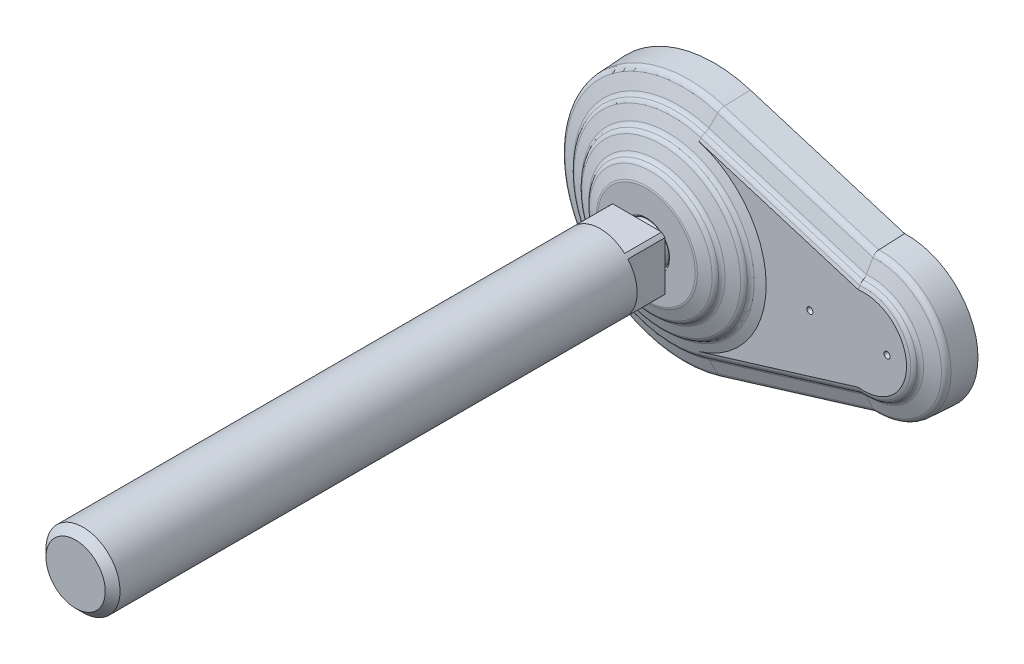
ISO-10303-21;
HEADER;
FILE_DESCRIPTION(('STEP AP214'),'2;1');
FILE_NAME('part.step','',(''),(''),'','','');
FILE_SCHEMA(('AUTOMOTIVE_DESIGN { 1 0 10303 214 1 1 1 1 }'));
ENDSEC;
DATA;
#1=APPLICATION_CONTEXT('core data for automotive mechanical design processes');
#2=APPLICATION_PROTOCOL_DEFINITION('international standard','automotive_design',2000,#1);
#3=PRODUCT_CONTEXT('',#1,'mechanical');
#4=PRODUCT('Part','Part','',(#3));
#5=PRODUCT_RELATED_PRODUCT_CATEGORY('part','',(#4));
#6=PRODUCT_DEFINITION_FORMATION('','',#4);
#7=PRODUCT_DEFINITION_CONTEXT('part definition',#1,'design');
#8=PRODUCT_DEFINITION('design','',#6,#7);
#9=PRODUCT_DEFINITION_SHAPE('','',#8);
#10=(LENGTH_UNIT() NAMED_UNIT(*) SI_UNIT(.MILLI.,.METRE.));
#11=(NAMED_UNIT(*) PLANE_ANGLE_UNIT() SI_UNIT($,.RADIAN.));
#12=(NAMED_UNIT(*) SI_UNIT($,.STERADIAN.) SOLID_ANGLE_UNIT());
#13=UNCERTAINTY_MEASURE_WITH_UNIT(LENGTH_MEASURE(1.E-05),#10,'distance_accuracy_value','');
#14=(GEOMETRIC_REPRESENTATION_CONTEXT(3) GLOBAL_UNCERTAINTY_ASSIGNED_CONTEXT((#13)) GLOBAL_UNIT_ASSIGNED_CONTEXT((#10,
#11,#12)) REPRESENTATION_CONTEXT('',''));
#15=CARTESIAN_POINT('',(0.,0.,0.));
#16=DIRECTION('',(0.,0.,1.));
#17=DIRECTION('',(1.,0.,0.));
#18=AXIS2_PLACEMENT_3D('',#15,#16,#17);
#19=CARTESIAN_POINT('',(0.,0.,37.));
#20=DIRECTION('',(0.,0.,1.));
#21=DIRECTION('',(-1.,0.,0.));
#22=AXIS2_PLACEMENT_3D('',#19,#20,#21);
#23=CYLINDRICAL_SURFACE('',#22,12.);
#24=CARTESIAN_POINT('',(0.,0.,204.6));
#25=DIRECTION('',(0.,0.,1.));
#26=DIRECTION('',(-1.,0.,0.));
#27=AXIS2_PLACEMENT_3D('',#24,#25,#26);
#28=CIRCLE('',#27,12.);
#29=CARTESIAN_POINT('',(-12.,0.,204.6));
#30=VERTEX_POINT('',#29);
#31=EDGE_CURVE('E9',#30,#30,#28,.F.);
#32=ORIENTED_EDGE('',*,*,#31,.T.);
#33=EDGE_LOOP('',(#32));
#34=FACE_BOUND('',#33,.T.);
#35=DIRECTION('',(0.,0.,1.));
#36=VECTOR('',#35,1.);
#37=CARTESIAN_POINT('',(-7.93725393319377,-9.,37.));
#38=LINE('',#37,#36);
#39=CARTESIAN_POINT('',(-7.93725393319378,-9.,37.));
#40=VERTEX_POINT('',#39);
#41=CARTESIAN_POINT('',(-7.93725393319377,-9.,25.));
#42=VERTEX_POINT('',#41);
#43=EDGE_CURVE('E135',#40,#42,#38,.F.);
#44=ORIENTED_EDGE('',*,*,#43,.F.);
#45=CARTESIAN_POINT('',(0.,0.,37.));
#46=DIRECTION('',(0.,0.,1.));
#47=DIRECTION('',(0.,-1.,0.));
#48=AXIS2_PLACEMENT_3D('',#45,#46,#47);
#49=CIRCLE('',#48,12.);
#50=CARTESIAN_POINT('',(7.93725393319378,-9.,37.));
#51=VERTEX_POINT('',#50);
#52=EDGE_CURVE('E506',#40,#51,#49,.T.);
#53=ORIENTED_EDGE('',*,*,#52,.T.);
#54=DIRECTION('',(0.,0.,1.));
#55=VECTOR('',#54,1.);
#56=CARTESIAN_POINT('',(7.93725393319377,-9.,37.));
#57=LINE('',#56,#55);
#58=CARTESIAN_POINT('',(7.93725393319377,-9.,25.));
#59=VERTEX_POINT('',#58);
#60=EDGE_CURVE('E200',#59,#51,#57,.T.);
#61=ORIENTED_EDGE('',*,*,#60,.F.);
#62=CARTESIAN_POINT('',(0.,0.,25.));
#63=DIRECTION('',(0.,0.,1.));
#64=DIRECTION('',(-1.,0.,0.));
#65=AXIS2_PLACEMENT_3D('',#62,#63,#64);
#66=CIRCLE('',#65,12.);
#67=CARTESIAN_POINT('',(9.,-7.93725393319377,25.));
#68=VERTEX_POINT('',#67);
#69=EDGE_CURVE('E183',#59,#68,#66,.T.);
#70=ORIENTED_EDGE('',*,*,#69,.T.);
#71=DIRECTION('',(0.,0.,1.));
#72=VECTOR('',#71,1.);
#73=CARTESIAN_POINT('',(9.,-7.93725393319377,37.));
#74=LINE('',#73,#72);
#75=CARTESIAN_POINT('',(9.,-7.93725393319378,37.));
#76=VERTEX_POINT('',#75);
#77=EDGE_CURVE('E197',#76,#68,#74,.F.);
#78=ORIENTED_EDGE('',*,*,#77,.F.);
#79=CARTESIAN_POINT('',(9.,7.93725393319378,37.));
#80=VERTEX_POINT('',#79);
#81=EDGE_CURVE('E265',#76,#80,#49,.T.);
#82=ORIENTED_EDGE('',*,*,#81,.T.);
#83=DIRECTION('',(0.,0.,1.));
#84=VECTOR('',#83,1.);
#85=CARTESIAN_POINT('',(9.,7.93725393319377,37.));
#86=LINE('',#85,#84);
#87=CARTESIAN_POINT('',(9.,7.93725393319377,25.));
#88=VERTEX_POINT('',#87);
#89=EDGE_CURVE('E242',#88,#80,#86,.T.);
#90=ORIENTED_EDGE('',*,*,#89,.F.);
#91=CARTESIAN_POINT('',(7.93725393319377,9.,25.));
#92=VERTEX_POINT('',#91);
#93=EDGE_CURVE('E179',#88,#92,#66,.T.);
#94=ORIENTED_EDGE('',*,*,#93,.T.);
#95=DIRECTION('',(0.,0.,1.));
#96=VECTOR('',#95,1.);
#97=CARTESIAN_POINT('',(7.93725393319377,9.,37.));
#98=LINE('',#97,#96);
#99=CARTESIAN_POINT('',(7.93725393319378,9.,37.));
#100=VERTEX_POINT('',#99);
#101=EDGE_CURVE('E160',#100,#92,#98,.F.);
#102=ORIENTED_EDGE('',*,*,#101,.F.);
#103=CARTESIAN_POINT('',(-7.93725393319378,9.,37.));
#104=VERTEX_POINT('',#103);
#105=EDGE_CURVE('E173',#100,#104,#49,.T.);
#106=ORIENTED_EDGE('',*,*,#105,.T.);
#107=DIRECTION('',(0.,0.,1.));
#108=VECTOR('',#107,1.);
#109=CARTESIAN_POINT('',(-7.93725393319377,9.,37.));
#110=LINE('',#109,#108);
#111=CARTESIAN_POINT('',(-7.93725393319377,9.,25.));
#112=VERTEX_POINT('',#111);
#113=EDGE_CURVE('E158',#112,#104,#110,.T.);
#114=ORIENTED_EDGE('',*,*,#113,.F.);
#115=CARTESIAN_POINT('',(-9.,7.93725393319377,25.));
#116=VERTEX_POINT('',#115);
#117=EDGE_CURVE('E171',#112,#116,#66,.T.);
#118=ORIENTED_EDGE('',*,*,#117,.T.);
#119=DIRECTION('',(0.,0.,1.));
#120=VECTOR('',#119,1.);
#121=CARTESIAN_POINT('',(-9.,7.93725393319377,37.));
#122=LINE('',#121,#120);
#123=CARTESIAN_POINT('',(-9.,7.93725393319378,37.));
#124=VERTEX_POINT('',#123);
#125=EDGE_CURVE('E174',#124,#116,#122,.F.);
#126=ORIENTED_EDGE('',*,*,#125,.F.);
#127=CARTESIAN_POINT('',(-9.,-7.93725393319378,37.));
#128=VERTEX_POINT('',#127);
#129=EDGE_CURVE('E516',#124,#128,#49,.T.);
#130=ORIENTED_EDGE('',*,*,#129,.T.);
#131=DIRECTION('',(0.,0.,1.));
#132=VECTOR('',#131,1.);
#133=CARTESIAN_POINT('',(-9.,-7.93725393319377,37.));
#134=LINE('',#133,#132);
#135=CARTESIAN_POINT('',(-9.,-7.93725393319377,25.));
#136=VERTEX_POINT('',#135);
#137=EDGE_CURVE('E180',#136,#128,#134,.T.);
#138=ORIENTED_EDGE('',*,*,#137,.F.);
#139=EDGE_CURVE('E182',#136,#42,#66,.T.);
#140=ORIENTED_EDGE('',*,*,#139,.T.);
#141=EDGE_LOOP('',(#44,#53,#61,#70,#78,#82,#90,#94,#102,#106,#114,#118,#126,#130,#138,#140));
#142=FACE_BOUND('',#141,.T.);
#143=ADVANCED_FACE('F14',(#34,#142),#23,.T.);
#144=CARTESIAN_POINT('',(-5.26544933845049,0.,25.));
#145=DIRECTION('',(0.,0.,1.));
#146=DIRECTION('',(-1.,0.,0.));
#147=AXIS2_PLACEMENT_3D('',#144,#145,#146);
#148=PLANE('',#147);
#149=DIRECTION('',(0.,-1.,0.));
#150=VECTOR('',#149,1.);
#151=CARTESIAN_POINT('',(-9.,9.,25.));
#152=LINE('',#151,#150);
#153=EDGE_CURVE('E31',#116,#136,#152,.T.);
#154=ORIENTED_EDGE('',*,*,#153,.F.);
#155=ORIENTED_EDGE('',*,*,#117,.F.);
#156=DIRECTION('',(-1.,0.,0.));
#157=VECTOR('',#156,1.);
#158=CARTESIAN_POINT('',(9.,9.,25.));
#159=LINE('',#158,#157);
#160=EDGE_CURVE('E153',#92,#112,#159,.T.);
#161=ORIENTED_EDGE('',*,*,#160,.F.);
#162=ORIENTED_EDGE('',*,*,#93,.F.);
#163=DIRECTION('',(0.,1.,0.));
#164=VECTOR('',#163,1.);
#165=CARTESIAN_POINT('',(9.,-9.,25.));
#166=LINE('',#165,#164);
#167=EDGE_CURVE('E165',#68,#88,#166,.T.);
#168=ORIENTED_EDGE('',*,*,#167,.F.);
#169=ORIENTED_EDGE('',*,*,#69,.F.);
#170=DIRECTION('',(1.,0.,0.));
#171=VECTOR('',#170,1.);
#172=CARTESIAN_POINT('',(-9.,-9.,25.));
#173=LINE('',#172,#171);
#174=EDGE_CURVE('E202',#42,#59,#173,.T.);
#175=ORIENTED_EDGE('',*,*,#174,.F.);
#176=ORIENTED_EDGE('',*,*,#139,.F.);
#177=EDGE_LOOP('',(#154,#155,#161,#162,#168,#169,#175,#176));
#178=FACE_BOUND('',#177,.T.);
#179=CARTESIAN_POINT('',(0.,0.,25.));
#180=DIRECTION('',(0.,0.,1.));
#181=DIRECTION('',(-1.,0.,0.));
#182=AXIS2_PLACEMENT_3D('',#179,#180,#181);
#183=CIRCLE('',#182,5.26544933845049);
#184=CARTESIAN_POINT('',(-5.26544933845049,0.,25.));
#185=VERTEX_POINT('',#184);
#186=EDGE_CURVE('E188',#185,#185,#183,.T.);
#187=ORIENTED_EDGE('',*,*,#186,.T.);
#188=EDGE_LOOP('',(#187));
#189=FACE_BOUND('',#188,.T.);
#190=ADVANCED_FACE('F176',(#178,#189),#148,.F.);
#191=CARTESIAN_POINT('',(0.,0.,18.6509999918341));
#192=DIRECTION('',(0.,0.,1.));
#193=DIRECTION('',(-1.,0.,0.));
#194=AXIS2_PLACEMENT_3D('',#191,#192,#193);
#195=DEGENERATE_TOROIDAL_SURFACE('',#194,0.000333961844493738,6.829,.T.);
#196=CARTESIAN_POINT('',(0.,0.,19.794));
#197=DIRECTION('',(0.,0.,-1.));
#198=DIRECTION('',(1.,0.,0.));
#199=AXIS2_PLACEMENT_3D('',#196,#197,#198);
#200=CIRCLE('',#199,6.733);
#201=CARTESIAN_POINT('',(6.733,0.,19.794));
#202=VERTEX_POINT('',#201);
#203=EDGE_CURVE('E249',#202,#202,#200,.T.);
#204=ORIENTED_EDGE('',*,*,#203,.F.);
#205=EDGE_LOOP('',(#204));
#206=FACE_BOUND('',#205,.T.);
#207=CARTESIAN_POINT('',(0.,0.,23.));
#208=DIRECTION('',(0.,0.,1.));
#209=DIRECTION('',(-1.,0.,0.));
#210=AXIS2_PLACEMENT_3D('',#207,#208,#209);
#211=CIRCLE('',#210,5.2654493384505);
#212=CARTESIAN_POINT('',(-5.2654493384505,0.,23.));
#213=VERTEX_POINT('',#212);
#214=EDGE_CURVE('E190',#213,#213,#211,.T.);
#215=ORIENTED_EDGE('',*,*,#214,.F.);
#216=EDGE_LOOP('',(#215));
#217=FACE_BOUND('',#216,.T.);
#218=ADVANCED_FACE('F450',(#206,#217),#195,.T.);
#219=CARTESIAN_POINT('',(0.,0.,37.));
#220=DIRECTION('',(0.,0.,1.));
#221=DIRECTION('',(-1.,0.,0.));
#222=AXIS2_PLACEMENT_3D('',#219,#220,#221);
#223=CYLINDRICAL_SURFACE('',#222,5.2654493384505);
#224=ORIENTED_EDGE('',*,*,#186,.F.);
#225=EDGE_LOOP('',(#224));
#226=FACE_BOUND('',#225,.T.);
#227=ORIENTED_EDGE('',*,*,#214,.T.);
#228=EDGE_LOOP('',(#227));
#229=FACE_BOUND('',#228,.T.);
#230=ADVANCED_FACE('F529',(#226,#229),#223,.T.);
#231=CARTESIAN_POINT('',(-9.,-9.,25.));
#232=DIRECTION('',(0.,-1.,0.));
#233=DIRECTION('',(1.,0.,0.));
#234=AXIS2_PLACEMENT_3D('',#231,#232,#233);
#235=PLANE('',#234);
#236=ORIENTED_EDGE('',*,*,#60,.T.);
#237=DIRECTION('',(-1.,0.,0.));
#238=VECTOR('',#237,1.);
#239=CARTESIAN_POINT('',(-12.,-9.,37.));
#240=LINE('',#239,#238);
#241=EDGE_CURVE('E214',#51,#40,#240,.T.);
#242=ORIENTED_EDGE('',*,*,#241,.T.);
#243=ORIENTED_EDGE('',*,*,#43,.T.);
#244=ORIENTED_EDGE('',*,*,#174,.T.);
#245=EDGE_LOOP('',(#236,#242,#243,#244));
#246=FACE_BOUND('',#245,.T.);
#247=ADVANCED_FACE('F525',(#246),#235,.T.);
#248=CARTESIAN_POINT('',(9.,-9.,25.));
#249=DIRECTION('',(1.,0.,0.));
#250=DIRECTION('',(0.,1.,0.));
#251=AXIS2_PLACEMENT_3D('',#248,#249,#250);
#252=PLANE('',#251);
#253=ORIENTED_EDGE('',*,*,#89,.T.);
#254=DIRECTION('',(0.,-1.,0.));
#255=VECTOR('',#254,1.);
#256=CARTESIAN_POINT('',(9.,0.,37.));
#257=LINE('',#256,#255);
#258=EDGE_CURVE('E221',#80,#76,#257,.T.);
#259=ORIENTED_EDGE('',*,*,#258,.T.);
#260=ORIENTED_EDGE('',*,*,#77,.T.);
#261=ORIENTED_EDGE('',*,*,#167,.T.);
#262=EDGE_LOOP('',(#253,#259,#260,#261));
#263=FACE_BOUND('',#262,.T.);
#264=ADVANCED_FACE('F540',(#263),#252,.T.);
#265=CARTESIAN_POINT('',(9.,9.,25.));
#266=DIRECTION('',(0.,1.,0.));
#267=DIRECTION('',(-1.,0.,0.));
#268=AXIS2_PLACEMENT_3D('',#265,#266,#267);
#269=PLANE('',#268);
#270=ORIENTED_EDGE('',*,*,#113,.T.);
#271=DIRECTION('',(1.,0.,0.));
#272=VECTOR('',#271,1.);
#273=CARTESIAN_POINT('',(-12.,9.,37.));
#274=LINE('',#273,#272);
#275=EDGE_CURVE('E225',#104,#100,#274,.T.);
#276=ORIENTED_EDGE('',*,*,#275,.T.);
#277=ORIENTED_EDGE('',*,*,#101,.T.);
#278=ORIENTED_EDGE('',*,*,#160,.T.);
#279=EDGE_LOOP('',(#270,#276,#277,#278));
#280=FACE_BOUND('',#279,.T.);
#281=ADVANCED_FACE('F155',(#280),#269,.T.);
#282=CARTESIAN_POINT('',(-9.,9.,25.));
#283=DIRECTION('',(-1.,0.,0.));
#284=DIRECTION('',(0.,-1.,0.));
#285=AXIS2_PLACEMENT_3D('',#282,#283,#284);
#286=PLANE('',#285);
#287=ORIENTED_EDGE('',*,*,#137,.T.);
#288=DIRECTION('',(0.,1.,0.));
#289=VECTOR('',#288,1.);
#290=CARTESIAN_POINT('',(-9.,0.,37.));
#291=LINE('',#290,#289);
#292=EDGE_CURVE('E238',#128,#124,#291,.T.);
#293=ORIENTED_EDGE('',*,*,#292,.T.);
#294=ORIENTED_EDGE('',*,*,#125,.T.);
#295=ORIENTED_EDGE('',*,*,#153,.T.);
#296=EDGE_LOOP('',(#287,#293,#294,#295));
#297=FACE_BOUND('',#296,.T.);
#298=ADVANCED_FACE('F461',(#297),#286,.T.);
#299=CARTESIAN_POINT('',(62.5,0.,0.));
#300=DIRECTION('',(0.,0.,-1.));
#301=DIRECTION('',(0.,1.,0.));
#302=AXIS2_PLACEMENT_3D('',#299,#300,#301);
#303=CONICAL_SURFACE('',#302,22.9787234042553,0.0523365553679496);
#304=CARTESIAN_POINT('',(62.5,0.,8.30411735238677));
#305=DIRECTION('',(0.,0.,1.));
#306=DIRECTION('',(0.,-1.,0.));
#307=AXIS2_PLACEMENT_3D('',#304,#305,#306);
#308=CIRCLE('',#307,22.5437172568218);
#309=CARTESIAN_POINT('',(61.6407011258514,-22.5273343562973,8.30411735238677));
#310=VERTEX_POINT('',#309);
#311=CARTESIAN_POINT('',(61.6407011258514,22.5273343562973,8.30411735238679));
#312=VERTEX_POINT('',#311);
#313=EDGE_CURVE('E284',#310,#312,#308,.T.);
#314=ORIENTED_EDGE('',*,*,#313,.F.);
#315=CARTESIAN_POINT('',(61.6406997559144,-22.5273238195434,8.30431735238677));
#316=CARTESIAN_POINT('',(61.6501805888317,-22.600242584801,6.92023165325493));
#317=CARTESIAN_POINT('',(61.6596900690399,-22.6731526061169,5.53614569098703));
#318=CARTESIAN_POINT('',(61.6787663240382,-22.8189551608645,2.76797324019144));
#319=CARTESIAN_POINT('',(61.6883330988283,-22.8918476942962,1.38388675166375));
#320=CARTESIAN_POINT('',(61.6979285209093,-22.9647314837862,-0.00020000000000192));
#321=B_SPLINE_CURVE_WITH_KNOTS('',3,(#315,#316,#317,#318,#319,#320),.UNSPECIFIED.,.F.,.F.,(4,2,
4),(0.,4.15811282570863,8.31622565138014),.UNSPECIFIED.);
#322=CARTESIAN_POINT('',(61.697927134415,-22.9647209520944,0.));
#323=VERTEX_POINT('',#322);
#324=EDGE_CURVE('E691',#310,#323,#321,.T.);
#325=ORIENTED_EDGE('',*,*,#324,.T.);
#326=CARTESIAN_POINT('',(62.5,0.,0.));
#327=DIRECTION('',(0.,0.,1.));
#328=DIRECTION('',(0.,-1.,0.));
#329=AXIS2_PLACEMENT_3D('',#326,#327,#328);
#330=CIRCLE('',#329,22.9787234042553);
#331=CARTESIAN_POINT('',(61.6979271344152,22.9647209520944,0.));
#332=VERTEX_POINT('',#331);
#333=EDGE_CURVE('E286',#323,#332,#330,.T.);
#334=ORIENTED_EDGE('',*,*,#333,.T.);
#335=CARTESIAN_POINT('',(61.6979285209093,22.9647314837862,-0.00019999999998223));
#336=CARTESIAN_POINT('',(61.6883330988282,22.8918476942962,1.38388675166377));
#337=CARTESIAN_POINT('',(61.6787663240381,22.8189551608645,2.76797324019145));
#338=CARTESIAN_POINT('',(61.6596900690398,22.6731526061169,5.53614569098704));
#339=CARTESIAN_POINT('',(61.6501805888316,22.600242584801,6.92023165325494));
#340=CARTESIAN_POINT('',(61.6406997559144,22.5273238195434,8.30431735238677));
#341=B_SPLINE_CURVE_WITH_KNOTS('',3,(#335,#336,#337,#338,#339,#340),.UNSPECIFIED.,.F.,.F.,(4,2,
4),(0.,4.1581128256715,8.31622565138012),.UNSPECIFIED.);
#342=EDGE_CURVE('E700',#332,#312,#341,.T.);
#343=ORIENTED_EDGE('',*,*,#342,.T.);
#344=EDGE_LOOP('',(#314,#325,#334,#343));
#345=FACE_BOUND('',#344,.T.);
#346=ADVANCED_FACE('F455',(#345),#303,.T.);
#347=CARTESIAN_POINT('',(64.1644462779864,-21.755748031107,8.30411735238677));
#348=DIRECTION('',(-0.291971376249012,0.9549953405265,-0.0523126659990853));
#349=DIRECTION('',(-0.956304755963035,-0.292371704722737,0.));
#350=AXIS2_PLACEMENT_3D('',#347,#348,#349);
#351=PLANE('',#350);
#352=ORIENTED_EDGE('',*,*,#324,.F.);
#353=DIRECTION('',(-0.956304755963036,-0.292371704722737,0.));
#354=VECTOR('',#353,1.);
#355=CARTESIAN_POINT('',(64.1644462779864,-21.755748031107,8.30411735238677));
#356=LINE('',#355,#354);
#357=CARTESIAN_POINT('',(11.5676847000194,-37.8361917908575,8.30411735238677));
#358=VERTEX_POINT('',#357);
#359=EDGE_CURVE('E620',#310,#358,#356,.T.);
#360=ORIENTED_EDGE('',*,*,#359,.T.);
#361=DIRECTION('',(-0.0152947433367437,0.050026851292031,0.998630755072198));
#362=VECTOR('',#361,1.);
#363=CARTESIAN_POINT('',(11.6948681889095,-38.2521902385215,0.));
#364=LINE('',#363,#362);
#365=CARTESIAN_POINT('',(11.6948681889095,-38.2521902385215,0.));
#366=VERTEX_POINT('',#365);
#367=EDGE_CURVE('E633',#366,#358,#364,.T.);
#368=ORIENTED_EDGE('',*,*,#367,.F.);
#369=DIRECTION('',(-0.956304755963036,-0.292371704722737,0.));
#370=VECTOR('',#369,1.);
#371=CARTESIAN_POINT('',(64.2916297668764,-22.1717464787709,0.));
#372=LINE('',#371,#370);
#373=EDGE_CURVE('E126',#323,#366,#372,.T.);
#374=ORIENTED_EDGE('',*,*,#373,.F.);
#375=EDGE_LOOP('',(#352,#360,#368,#374));
#376=FACE_BOUND('',#375,.T.);
#377=ADVANCED_FACE('F446',(#376),#351,.F.);
#378=CARTESIAN_POINT('',(0.,0.,0.));
#379=DIRECTION('',(0.,0.,1.));
#380=DIRECTION('',(-1.,0.,0.));
#381=AXIS2_PLACEMENT_3D('',#378,#379,#380);
#382=PLANE('',#381);
#383=DIRECTION('',(-0.956304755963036,0.292371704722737,0.));
#384=VECTOR('',#383,1.);
#385=CARTESIAN_POINT('',(64.2916297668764,22.1717464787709,0.));
#386=LINE('',#385,#384);
#387=CARTESIAN_POINT('',(11.6948681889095,38.2521902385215,0.));
#388=VERTEX_POINT('',#387);
#389=EDGE_CURVE('E618',#332,#388,#386,.T.);
#390=ORIENTED_EDGE('',*,*,#389,.F.);
#391=ORIENTED_EDGE('',*,*,#333,.F.);
#392=ORIENTED_EDGE('',*,*,#373,.T.);
#393=CARTESIAN_POINT('',(0.,0.,0.));
#394=DIRECTION('',(0.,0.,1.));
#395=DIRECTION('',(-1.,0.,0.));
#396=AXIS2_PLACEMENT_3D('',#393,#394,#395);
#397=CIRCLE('',#396,40.);
#398=EDGE_CURVE('E327',#388,#366,#397,.T.);
#399=ORIENTED_EDGE('',*,*,#398,.F.);
#400=EDGE_LOOP('',(#390,#391,#392,#399));
#401=FACE_BOUND('',#400,.T.);
#402=CARTESIAN_POINT('',(45.,0.,0.));
#403=DIRECTION('',(0.,0.,-1.));
#404=DIRECTION('',(0.,1.,0.));
#405=AXIS2_PLACEMENT_3D('',#402,#403,#404);
#406=CIRCLE('',#405,5.25);
#407=CARTESIAN_POINT('',(45.,5.25,0.));
#408=VERTEX_POINT('',#407);
#409=EDGE_CURVE('E503',#408,#408,#406,.T.);
#410=ORIENTED_EDGE('',*,*,#409,.F.);
#411=EDGE_LOOP('',(#410));
#412=FACE_BOUND('',#411,.T.);
#413=CARTESIAN_POINT('',(70.,0.,0.));
#414=DIRECTION('',(0.,0.,-1.));
#415=DIRECTION('',(0.,1.,0.));
#416=AXIS2_PLACEMENT_3D('',#413,#414,#415);
#417=CIRCLE('',#416,5.25);
#418=CARTESIAN_POINT('',(70.,5.25,0.));
#419=VERTEX_POINT('',#418);
#420=EDGE_CURVE('E500',#419,#419,#417,.T.);
#421=ORIENTED_EDGE('',*,*,#420,.F.);
#422=EDGE_LOOP('',(#421));
#423=FACE_BOUND('',#422,.T.);
#424=ADVANCED_FACE('F336',(#401,#412,#423),#382,.F.);
#425=CARTESIAN_POINT('',(64.2916297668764,22.1717464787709,0.));
#426=DIRECTION('',(-0.291971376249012,-0.9549953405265,-0.0523126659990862));
#427=DIRECTION('',(0.956304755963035,-0.292371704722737,0.));
#428=AXIS2_PLACEMENT_3D('',#425,#426,#427);
#429=PLANE('',#428);
#430=ORIENTED_EDGE('',*,*,#342,.F.);
#431=ORIENTED_EDGE('',*,*,#389,.T.);
#432=DIRECTION('',(-0.0152947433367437,-0.050026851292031,0.998630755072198));
#433=VECTOR('',#432,1.);
#434=CARTESIAN_POINT('',(11.6948681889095,38.2521902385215,0.));
#435=LINE('',#434,#433);
#436=CARTESIAN_POINT('',(11.5676847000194,37.8361917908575,8.30411735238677));
#437=VERTEX_POINT('',#436);
#438=EDGE_CURVE('E651',#388,#437,#435,.T.);
#439=ORIENTED_EDGE('',*,*,#438,.T.);
#440=DIRECTION('',(-0.956304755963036,0.292371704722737,0.));
#441=VECTOR('',#440,1.);
#442=CARTESIAN_POINT('',(64.1644462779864,21.755748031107,8.30411735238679));
#443=LINE('',#442,#441);
#444=EDGE_CURVE('E616',#312,#437,#443,.T.);
#445=ORIENTED_EDGE('',*,*,#444,.F.);
#446=EDGE_LOOP('',(#430,#431,#439,#445));
#447=FACE_BOUND('',#446,.T.);
#448=ADVANCED_FACE('F416',(#447),#429,.F.);
#449=CARTESIAN_POINT('',(62.5,0.,8.19912580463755));
#450=DIRECTION('',(0.,0.,1.));
#451=DIRECTION('',(0.,-1.,0.));
#452=AXIS2_PLACEMENT_3D('',#449,#450,#451);
#453=TOROIDAL_SURFACE('',#452,20.5394653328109,2.007);
#454=CARTESIAN_POINT('',(61.6407233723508,-22.5275054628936,8.09743405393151));
#455=CARTESIAN_POINT('',(61.6409510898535,-22.5292569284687,8.13179934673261));
#456=CARTESIAN_POINT('',(61.6410635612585,-22.5301219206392,8.16619641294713));
#457=CARTESIAN_POINT('',(61.6410572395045,-22.5300732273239,8.23504586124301));
#458=CARTESIAN_POINT('',(61.6409380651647,-22.5291566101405,8.26949824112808));
#459=CARTESIAN_POINT('',(61.6399396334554,-22.5214778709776,8.41537858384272));
#460=CARTESIAN_POINT('',(61.6379561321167,-22.5062239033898,8.52649092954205));
#461=CARTESIAN_POINT('',(61.6316126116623,-22.4573679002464,8.74462326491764));
#462=CARTESIAN_POINT('',(61.6272490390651,-22.4237384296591,8.85163687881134));
#463=CARTESIAN_POINT('',(61.6163034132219,-22.339189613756,9.05835724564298));
#464=CARTESIAN_POINT('',(61.6097238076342,-22.2882893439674,9.1580719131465));
#465=CARTESIAN_POINT('',(61.5945702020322,-22.1707054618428,9.34754679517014));
#466=CARTESIAN_POINT('',(61.5859960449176,-22.1040206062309,9.43730622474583));
#467=CARTESIAN_POINT('',(61.5670698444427,-21.9562760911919,9.60507832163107));
#468=CARTESIAN_POINT('',(61.5567047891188,-21.8751110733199,9.68299656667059));
#469=CARTESIAN_POINT('',(61.5345911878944,-21.7011851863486,9.82410142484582));
#470=CARTESIAN_POINT('',(61.5228449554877,-21.6084436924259,9.88731215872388));
#471=CARTESIAN_POINT('',(61.5046129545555,-21.4637836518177,9.96928669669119));
#472=CARTESIAN_POINT('',(61.4985079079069,-21.4152343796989,9.99425235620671));
#473=CARTESIAN_POINT('',(61.4860940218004,-21.3162718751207,10.0401972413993));
#474=CARTESIAN_POINT('',(61.4797850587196,-21.2658575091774,10.0611739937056));
#475=CARTESIAN_POINT('',(61.4596293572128,-21.1043762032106,10.1208327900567));
#476=CARTESIAN_POINT('',(61.4454888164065,-20.9904779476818,10.1519983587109));
#477=CARTESIAN_POINT('',(61.4169436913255,-20.7591475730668,10.1941665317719));
#478=CARTESIAN_POINT('',(61.4025394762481,-20.6417202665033,10.2051954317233));
#479=CARTESIAN_POINT('',(61.3876252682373,-20.5193667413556,10.2061070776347));
#480=CARTESIAN_POINT('',(61.3870090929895,-20.5143103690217,10.2061258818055));
#481=CARTESIAN_POINT('',(61.3863931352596,-20.5092543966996,10.2061258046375));
#482=B_SPLINE_CURVE_WITH_KNOTS('',3,(#454,#455,#456,#457,#458,#459,#460,#461,#462,#463,#464,
#465,#466,#467,#468,#469,#470,#471,#472,#473,#474,#475,#476,#477,#478,#479,#480,#481),
.UNSPECIFIED.,.F.,.F.,(4,2,2,2,2,2,2,2,2,2,2,2,2,4),(0.,0.103191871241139,0.20655369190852,
0.54127575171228,0.87649892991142,1.21135305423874,1.54623356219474,1.88365820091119,
2.2205254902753,2.38517216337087,2.54992059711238,2.90486008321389,3.2593357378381,
3.2746170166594),.UNSPECIFIED.);
#483=CARTESIAN_POINT('',(61.4734629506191,-21.2152067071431,10.0798866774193));
#484=VERTEX_POINT('',#483);
#485=EDGE_CURVE('E693',#310,#484,#482,.T.);
#486=ORIENTED_EDGE('',*,*,#485,.F.);
#487=ORIENTED_EDGE('',*,*,#313,.T.);
#488=CARTESIAN_POINT('',(61.3863931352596,20.5092543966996,10.2061258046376));
#489=CARTESIAN_POINT('',(61.3870091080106,20.5143104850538,10.2061258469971));
#490=CARTESIAN_POINT('',(61.3876252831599,20.5193668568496,10.206107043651));
#491=CARTESIAN_POINT('',(61.3988855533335,20.6117442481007,10.2054193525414));
#492=CARTESIAN_POINT('',(61.4095840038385,20.6991031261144,10.1991511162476));
#493=CARTESIAN_POINT('',(61.4308936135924,20.8723273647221,10.1754412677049));
#494=CARTESIAN_POINT('',(61.4415047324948,20.9581920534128,10.1579947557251));
#495=CARTESIAN_POINT('',(61.4555813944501,21.0716202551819,10.1272225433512));
#496=CARTESIAN_POINT('',(61.4591730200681,21.1005182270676,10.1186877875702));
#497=CARTESIAN_POINT('',(61.4663157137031,21.1579059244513,10.1003430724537));
#498=CARTESIAN_POINT('',(61.4698667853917,21.1863956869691,10.090533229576));
#499=CARTESIAN_POINT('',(61.4866782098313,21.3210820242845,10.0407628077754));
#500=CARTESIAN_POINT('',(61.4996430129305,21.4243838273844,9.99241683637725));
#501=CARTESIAN_POINT('',(61.5245148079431,21.6216549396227,9.87891981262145));
#502=CARTESIAN_POINT('',(61.5364193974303,21.7156031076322,9.81373183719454));
#503=CARTESIAN_POINT('',(61.5587594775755,21.8912250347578,9.66834297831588));
#504=CARTESIAN_POINT('',(61.5691956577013,21.9729045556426,9.58814918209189));
#505=CARTESIAN_POINT('',(61.5882470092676,22.1215501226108,9.41495435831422));
#506=CARTESIAN_POINT('',(61.5968625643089,22.1885192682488,9.32195603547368));
#507=CARTESIAN_POINT('',(61.6119005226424,22.3051440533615,9.12674801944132));
#508=CARTESIAN_POINT('',(61.6183432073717,22.3549598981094,9.02463544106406));
#509=CARTESIAN_POINT('',(61.6289130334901,22.4365717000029,8.81343456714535));
#510=CARTESIAN_POINT('',(61.6330436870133,22.4683949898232,8.70435713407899));
#511=CARTESIAN_POINT('',(61.6371976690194,22.5003783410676,8.54571963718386));
#512=CARTESIAN_POINT('',(61.6382205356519,22.5082502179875,8.49762935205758));
#513=CARTESIAN_POINT('',(61.639806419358,22.5204527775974,8.40103137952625));
#514=CARTESIAN_POINT('',(61.6403698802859,22.52478687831,8.35252414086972));
#515=CARTESIAN_POINT('',(61.6411729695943,22.5309631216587,8.23516417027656));
#516=CARTESIAN_POINT('',(61.641181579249,22.5310278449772,8.16621181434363));
#517=CARTESIAN_POINT('',(61.6407233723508,22.5275054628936,8.09743405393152));
#518=B_SPLINE_CURVE_WITH_KNOTS('',3,(#488,#489,#490,#491,#492,#493,#494,#495,#496,#497,#498,
#499,#500,#501,#502,#503,#504,#505,#506,#507,#508,#509,#510,#511,#512,#513,#514,#515,#516,#517),
.UNSPECIFIED.,.F.,.F.,(4,2,2,2,2,2,2,2,2,2,2,2,2,2,4),(0.,0.0152812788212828,0.27917431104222,
0.543183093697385,0.634194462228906,0.725197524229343,1.06775959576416,1.41107914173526,
1.75423694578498,2.09732237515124,2.43711059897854,2.77638125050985,2.92250118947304,
3.06847978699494,3.27496314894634),.UNSPECIFIED.);
#519=CARTESIAN_POINT('',(61.4734629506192,21.2152067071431,10.0798866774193));
#520=VERTEX_POINT('',#519);
#521=EDGE_CURVE('E405',#520,#312,#518,.T.);
#522=ORIENTED_EDGE('',*,*,#521,.F.);
#523=CARTESIAN_POINT('',(62.5,0.,10.0798866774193));
#524=DIRECTION('',(0.,0.,1.));
#525=DIRECTION('',(0.,-1.,0.));
#526=AXIS2_PLACEMENT_3D('',#523,#524,#525);
#527=CIRCLE('',#526,21.2400276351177);
#528=EDGE_CURVE('E282',#484,#520,#527,.T.);
#529=ORIENTED_EDGE('',*,*,#528,.F.);
#530=EDGE_LOOP('',(#486,#487,#522,#529));
#531=FACE_BOUND('',#530,.T.);
#532=ADVANCED_FACE('F387',(#531),#453,.T.);
#533=CARTESIAN_POINT('',(63.5784597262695,-19.8390723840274,8.19912580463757));
#534=DIRECTION('',(-0.956304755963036,-0.292371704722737,0.));
#535=DIRECTION('',(0.292371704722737,-0.956304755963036,0.));
#536=AXIS2_PLACEMENT_3D('',#533,#534,#535);
#537=CYLINDRICAL_SURFACE('',#536,2.00699999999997);
#538=ORIENTED_EDGE('',*,*,#359,.F.);
#539=ORIENTED_EDGE('',*,*,#485,.T.);
#540=DIRECTION('',(-0.956304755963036,-0.292371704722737,0.));
#541=VECTOR('',#540,1.);
#542=CARTESIAN_POINT('',(63.7832843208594,-20.5090234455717,10.0798866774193));
#543=LINE('',#542,#541);
#544=CARTESIAN_POINT('',(11.1865227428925,-36.5894672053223,10.0798866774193));
#545=VERTEX_POINT('',#544);
#546=EDGE_CURVE('E622',#484,#545,#543,.T.);
#547=ORIENTED_EDGE('',*,*,#546,.T.);
#548=CARTESIAN_POINT('',(10.9816981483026,-35.9195161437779,8.19912580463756));
#549=DIRECTION('',(0.956304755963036,0.292371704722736,0.));
#550=DIRECTION('',(-0.292371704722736,0.956304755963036,0.));
#551=AXIS2_PLACEMENT_3D('',#548,#549,#550);
#552=CIRCLE('',#551,2.007);
#553=EDGE_CURVE('E636',#545,#358,#552,.T.);
#554=ORIENTED_EDGE('',*,*,#553,.T.);
#555=EDGE_LOOP('',(#538,#539,#547,#554));
#556=FACE_BOUND('',#555,.T.);
#557=ADVANCED_FACE('F417',(#556),#537,.T.);
#558=CARTESIAN_POINT('',(0.,0.,0.));
#559=DIRECTION('',(0.,0.,-1.));
#560=DIRECTION('',(1.,0.,0.));
#561=AXIS2_PLACEMENT_3D('',#558,#559,#560);
#562=CONICAL_SURFACE('',#561,40.,0.0523365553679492);
#563=CARTESIAN_POINT('',(0.,0.,8.30411735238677));
#564=DIRECTION('',(0.,0.,1.));
#565=DIRECTION('',(-1.,0.,0.));
#566=AXIS2_PLACEMENT_3D('',#563,#564,#565);
#567=CIRCLE('',#566,39.5649938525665);
#568=EDGE_CURVE('E680',#437,#358,#567,.T.);
#569=ORIENTED_EDGE('',*,*,#568,.F.);
#570=ORIENTED_EDGE('',*,*,#438,.F.);
#571=ORIENTED_EDGE('',*,*,#398,.T.);
#572=ORIENTED_EDGE('',*,*,#367,.T.);
#573=EDGE_LOOP('',(#569,#570,#571,#572));
#574=FACE_BOUND('',#573,.T.);
#575=ADVANCED_FACE('F437',(#574),#562,.T.);
#576=CARTESIAN_POINT('',(63.5784597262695,19.8390723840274,8.1991258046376));
#577=DIRECTION('',(-0.956304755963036,0.292371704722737,0.));
#578=DIRECTION('',(-0.292371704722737,-0.956304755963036,0.));
#579=AXIS2_PLACEMENT_3D('',#576,#577,#578);
#580=CYLINDRICAL_SURFACE('',#579,2.00699999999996);
#581=DIRECTION('',(-0.956304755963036,0.292371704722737,0.));
#582=VECTOR('',#581,1.);
#583=CARTESIAN_POINT('',(63.7832843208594,20.5090234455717,10.0798866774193));
#584=LINE('',#583,#582);
#585=CARTESIAN_POINT('',(11.1865227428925,36.5894672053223,10.0798866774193));
#586=VERTEX_POINT('',#585);
#587=EDGE_CURVE('E614',#520,#586,#584,.T.);
#588=ORIENTED_EDGE('',*,*,#587,.F.);
#589=ORIENTED_EDGE('',*,*,#521,.T.);
#590=ORIENTED_EDGE('',*,*,#444,.T.);
#591=CARTESIAN_POINT('',(10.9816981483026,35.9195161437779,8.19912580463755));
#592=DIRECTION('',(-0.956304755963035,0.292371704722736,0.));
#593=DIRECTION('',(-0.292371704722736,-0.956304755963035,0.));
#594=AXIS2_PLACEMENT_3D('',#591,#592,#593);
#595=CIRCLE('',#594,2.007);
#596=EDGE_CURVE('E654',#586,#437,#595,.T.);
#597=ORIENTED_EDGE('',*,*,#596,.F.);
#598=EDGE_LOOP('',(#588,#589,#590,#597));
#599=FACE_BOUND('',#598,.T.);
#600=ADVANCED_FACE('F345',(#599),#580,.T.);
#601=CARTESIAN_POINT('',(62.5,0.,10.0798866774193));
#602=DIRECTION('',(0.,0.,-1.));
#603=DIRECTION('',(0.,1.,0.));
#604=AXIS2_PLACEMENT_3D('',#601,#602,#603);
#605=CONICAL_SURFACE('',#604,21.2400276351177,1.21422909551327);
#606=CARTESIAN_POINT('',(62.5,0.,11.656251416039));
#607=DIRECTION('',(0.,0.,1.));
#608=DIRECTION('',(0.,-1.,0.));
#609=AXIS2_PLACEMENT_3D('',#606,#607,#608);
#610=CIRCLE('',#609,17.0080484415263);
#611=CARTESIAN_POINT('',(60.9818619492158,-16.9401584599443,11.656251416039));
#612=VERTEX_POINT('',#611);
#613=CARTESIAN_POINT('',(60.9818619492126,16.9401584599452,11.656251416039));
#614=VERTEX_POINT('',#613);
#615=EDGE_CURVE('E280',#612,#614,#610,.T.);
#616=ORIENTED_EDGE('',*,*,#615,.F.);
#617=CARTESIAN_POINT('',(60.9818053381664,-16.9396143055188,11.656451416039));
#618=CARTESIAN_POINT('',(61.0189355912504,-17.2964789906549,11.5252879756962));
#619=CARTESIAN_POINT('',(61.0571375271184,-17.653206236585,11.3940567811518));
#620=CARTESIAN_POINT('',(61.1355151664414,-18.3663907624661,11.1314756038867));
#621=CARTESIAN_POINT('',(61.1756908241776,-18.7228480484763,11.0001256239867));
#622=CARTESIAN_POINT('',(61.2578477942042,-19.435511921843,10.7373183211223));
#623=CARTESIAN_POINT('',(61.2998290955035,-19.7917185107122,10.6058609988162));
#624=CARTESIAN_POINT('',(61.3854616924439,-20.5039033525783,10.3428458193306));
#625=CARTESIAN_POINT('',(61.4291130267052,-20.8598816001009,10.2112879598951));
#626=CARTESIAN_POINT('',(61.4735304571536,-21.2157475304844,10.0796866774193));
#627=B_SPLINE_CURVE_WITH_KNOTS('',3,(#617,#618,#619,#620,#621,#622,#623,#624,#625,#626),
.UNSPECIFIED.,.F.,.F.,(4,2,2,2,4),(0.,1.14603990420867,2.29205327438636,3.43805966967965,
4.58409258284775),.UNSPECIFIED.);
#628=EDGE_CURVE('E397',#612,#484,#627,.T.);
#629=ORIENTED_EDGE('',*,*,#628,.T.);
#630=ORIENTED_EDGE('',*,*,#528,.T.);
#631=CARTESIAN_POINT('',(61.4735304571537,21.2157475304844,10.0796866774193));
#632=CARTESIAN_POINT('',(61.4291130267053,20.8598816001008,10.2112879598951));
#633=CARTESIAN_POINT('',(61.3854616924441,20.5039033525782,10.3428458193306));
#634=CARTESIAN_POINT('',(61.2998290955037,19.7917185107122,10.6058609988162));
#635=CARTESIAN_POINT('',(61.2578477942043,19.435511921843,10.7373183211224));
#636=CARTESIAN_POINT('',(61.1756908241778,18.7228480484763,11.0001256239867));
#637=CARTESIAN_POINT('',(61.1355151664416,18.3663907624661,11.1314756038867));
#638=CARTESIAN_POINT('',(61.0571375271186,17.653206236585,11.3940567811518));
#639=CARTESIAN_POINT('',(61.0189355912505,17.2964789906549,11.5252879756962));
#640=CARTESIAN_POINT('',(60.9818053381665,16.9396143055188,11.656451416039));
#641=B_SPLINE_CURVE_WITH_KNOTS('',3,(#631,#632,#633,#634,#635,#636,#637,#638,#639,#640),
.UNSPECIFIED.,.F.,.F.,(4,2,2,2,4),(0.,1.1460329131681,2.29203930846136,3.43805267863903,
4.58409258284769),.UNSPECIFIED.);
#642=EDGE_CURVE('E391',#520,#614,#641,.T.);
#643=ORIENTED_EDGE('',*,*,#642,.T.);
#644=EDGE_LOOP('',(#616,#629,#630,#643));
#645=FACE_BOUND('',#644,.T.);
#646=ADVANCED_FACE('F380',(#645),#605,.T.);
#647=CARTESIAN_POINT('',(62.545973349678,-16.4619616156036,11.656251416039));
#648=DIRECTION('',(-0.102055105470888,0.333807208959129,-0.937100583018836));
#649=DIRECTION('',(0.,0.942019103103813,0.335559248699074));
#650=AXIS2_PLACEMENT_3D('',#647,#648,#649);
#651=PLANE('',#650);
#652=ORIENTED_EDGE('',*,*,#628,.F.);
#653=DIRECTION('',(-0.956304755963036,-0.292371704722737,0.));
#654=VECTOR('',#653,1.);
#655=CARTESIAN_POINT('',(62.545973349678,-16.4619616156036,11.656251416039));
#656=LINE('',#655,#654);
#657=CARTESIAN_POINT('',(9.949211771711,-32.5424053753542,11.656251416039));
#658=VERTEX_POINT('',#657);
#659=EDGE_CURVE('E624',#612,#658,#656,.T.);
#660=ORIENTED_EDGE('',*,*,#659,.T.);
#661=DIRECTION('',(-0.273981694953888,0.896153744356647,0.349059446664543));
#662=VECTOR('',#661,1.);
#663=CARTESIAN_POINT('',(11.1865227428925,-36.5894672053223,10.0798866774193));
#664=LINE('',#663,#662);
#665=EDGE_CURVE('E639',#545,#658,#664,.T.);
#666=ORIENTED_EDGE('',*,*,#665,.F.);
#667=ORIENTED_EDGE('',*,*,#546,.F.);
#668=EDGE_LOOP('',(#652,#660,#666,#667));
#669=FACE_BOUND('',#668,.T.);
#670=ADVANCED_FACE('F385',(#669),#651,.F.);
#671=CARTESIAN_POINT('',(0.,0.,8.19912580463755));
#672=DIRECTION('',(0.,0.,1.));
#673=DIRECTION('',(-1.,0.,0.));
#674=AXIS2_PLACEMENT_3D('',#671,#672,#673);
#675=TOROIDAL_SURFACE('',#674,37.5607419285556,2.007);
#676=CARTESIAN_POINT('',(0.,0.,10.0798866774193));
#677=DIRECTION('',(0.,0.,1.));
#678=DIRECTION('',(-1.,0.,0.));
#679=AXIS2_PLACEMENT_3D('',#676,#677,#678);
#680=CIRCLE('',#679,38.2613042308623);
#681=EDGE_CURVE('E678',#586,#545,#680,.T.);
#682=ORIENTED_EDGE('',*,*,#681,.F.);
#683=ORIENTED_EDGE('',*,*,#596,.T.);
#684=ORIENTED_EDGE('',*,*,#568,.T.);
#685=ORIENTED_EDGE('',*,*,#553,.F.);
#686=EDGE_LOOP('',(#682,#683,#684,#685));
#687=FACE_BOUND('',#686,.T.);
#688=ADVANCED_FACE('F414',(#687),#675,.T.);
#689=CARTESIAN_POINT('',(63.7832843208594,20.5090234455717,10.0798866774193));
#690=DIRECTION('',(-0.102055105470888,-0.333807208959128,-0.937100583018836));
#691=DIRECTION('',(0.,0.942019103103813,-0.335559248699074));
#692=AXIS2_PLACEMENT_3D('',#689,#690,#691);
#693=PLANE('',#692);
#694=ORIENTED_EDGE('',*,*,#642,.F.);
#695=ORIENTED_EDGE('',*,*,#587,.T.);
#696=DIRECTION('',(-0.273981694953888,-0.896153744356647,0.349059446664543));
#697=VECTOR('',#696,1.);
#698=CARTESIAN_POINT('',(11.1865227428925,36.5894672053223,10.0798866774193));
#699=LINE('',#698,#697);
#700=CARTESIAN_POINT('',(9.949211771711,32.5424053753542,11.656251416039));
#701=VERTEX_POINT('',#700);
#702=EDGE_CURVE('E657',#586,#701,#699,.T.);
#703=ORIENTED_EDGE('',*,*,#702,.T.);
#704=DIRECTION('',(-0.956304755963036,0.292371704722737,0.));
#705=VECTOR('',#704,1.);
#706=CARTESIAN_POINT('',(62.545973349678,16.4619616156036,11.656251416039));
#707=LINE('',#706,#705);
#708=EDGE_CURVE('E612',#614,#701,#707,.T.);
#709=ORIENTED_EDGE('',*,*,#708,.F.);
#710=EDGE_LOOP('',(#694,#695,#703,#709));
#711=FACE_BOUND('',#710,.T.);
#712=ADVANCED_FACE('F351',(#711),#693,.F.);
#713=CARTESIAN_POINT('',(62.5,0.,13.5370123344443));
#714=DIRECTION('',(0.,0.,1.));
#715=DIRECTION('',(0.,-1.,0.));
#716=AXIS2_PLACEMENT_3D('',#713,#714,#715);
#717=TOROIDAL_SURFACE('',#716,17.70861062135,2.007);
#718=CARTESIAN_POINT('',(60.9819185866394,-16.9407028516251,11.656051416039));
#719=CARTESIAN_POINT('',(60.9763282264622,-16.8869710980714,11.675784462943));
#720=CARTESIAN_POINT('',(60.9708503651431,-16.8340792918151,11.697757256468));
#721=CARTESIAN_POINT('',(60.9601474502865,-16.7302929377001,11.7460604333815));
#722=CARTESIAN_POINT('',(60.9549224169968,-16.6793985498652,11.77239116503));
#723=CARTESIAN_POINT('',(60.9396574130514,-16.5300811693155,11.8578002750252));
#724=CARTESIAN_POINT('',(60.9300410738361,-16.4351542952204,11.9232476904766));
#725=CARTESIAN_POINT('',(60.9121877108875,-16.2575900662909,12.0693279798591));
#726=CARTESIAN_POINT('',(60.9039521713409,-16.1749659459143,12.1499769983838));
#727=CARTESIAN_POINT('',(60.8890756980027,-16.0247595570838,12.3241094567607));
#728=CARTESIAN_POINT('',(60.8824301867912,-15.9571341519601,12.4175548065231));
#729=CARTESIAN_POINT('',(60.8754548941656,-15.8858007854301,12.5364334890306));
#730=CARTESIAN_POINT('',(60.8742920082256,-15.8738939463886,12.5571086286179));
#731=CARTESIAN_POINT('',(60.8720425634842,-15.8508368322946,12.59885583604));
#732=CARTESIAN_POINT('',(60.8709559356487,-15.839685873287,12.6199275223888));
#733=CARTESIAN_POINT('',(60.869906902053,-15.8289098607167,12.6412000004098));
#734=B_SPLINE_CURVE_WITH_KNOTS('',3,(#718,#719,#720,#721,#722,#723,#724,#725,#726,#727,#728,
#729,#730,#731,#732,#733),.UNSPECIFIED.,.F.,.F.,(4,2,2,2,2,2,2,4),(0.,0.172434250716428,
0.34488228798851,0.690191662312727,1.0358698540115,1.38054058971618,1.4521941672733,
1.52378201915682),.UNSPECIFIED.);
#735=CARTESIAN_POINT('',(60.8699167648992,-15.8290111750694,12.6410000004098));
#736=VERTEX_POINT('',#735);
#737=EDGE_CURVE('E362',#612,#736,#734,.T.);
#738=ORIENTED_EDGE('',*,*,#737,.F.);
#739=ORIENTED_EDGE('',*,*,#615,.T.);
#740=CARTESIAN_POINT('',(60.869906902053,15.8289098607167,12.6412000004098));
#741=CARTESIAN_POINT('',(60.8724049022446,15.8545692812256,12.5905409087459));
#742=CARTESIAN_POINT('',(60.8751177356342,15.882373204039,12.5410120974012));
#743=CARTESIAN_POINT('',(60.8809599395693,15.9420653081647,12.4445128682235));
#744=CARTESIAN_POINT('',(60.8840892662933,15.9739530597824,12.3975421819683));
#745=CARTESIAN_POINT('',(60.8940798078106,16.0754098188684,12.2609440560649));
#746=CARTESIAN_POINT('',(60.9015461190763,16.1507985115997,12.1755790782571));
#747=CARTESIAN_POINT('',(60.9179069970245,16.3146445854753,12.0187596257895));
#748=CARTESIAN_POINT('',(60.9268017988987,16.4031041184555,11.9473074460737));
#749=CARTESIAN_POINT('',(60.9458071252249,16.5904449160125,11.8202080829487));
#750=CARTESIAN_POINT('',(60.9559150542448,16.6893038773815,11.7645279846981));
#751=CARTESIAN_POINT('',(60.9690169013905,16.8162843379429,11.7062217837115));
#752=CARTESIAN_POINT('',(60.9715630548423,16.8409104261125,11.6954970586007));
#753=CARTESIAN_POINT('',(60.9767040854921,16.8905299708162,11.6750365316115));
#754=CARTESIAN_POINT('',(60.9792989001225,16.9155229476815,11.6652995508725));
#755=CARTESIAN_POINT('',(60.9819185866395,16.940702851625,11.656051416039));
#756=B_SPLINE_CURVE_WITH_KNOTS('',3,(#740,#741,#742,#743,#744,#745,#746,#747,#748,#749,#750,
#751,#752,#753,#754,#755),.UNSPECIFIED.,.F.,.F.,(4,2,2,2,2,2,2,4),(0.,0.170415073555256,
0.340812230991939,0.681435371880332,1.0221146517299,1.36207763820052,1.44300799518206,
1.52384059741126),.UNSPECIFIED.);
#757=CARTESIAN_POINT('',(60.8699167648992,15.8290111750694,12.6410000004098));
#758=VERTEX_POINT('',#757);
#759=EDGE_CURVE('E355',#758,#614,#756,.T.);
#760=ORIENTED_EDGE('',*,*,#759,.F.);
#761=CARTESIAN_POINT('',(62.5,0.,12.6410000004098));
#762=DIRECTION('',(0.,0.,1.));
#763=DIRECTION('',(0.,-1.,0.));
#764=AXIS2_PLACEMENT_3D('',#761,#762,#763);
#765=CIRCLE('',#764,15.9127234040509);
#766=EDGE_CURVE('E278',#736,#758,#765,.T.);
#767=ORIENTED_EDGE('',*,*,#766,.F.);
#768=EDGE_LOOP('',(#738,#739,#760,#767));
#769=FACE_BOUND('',#768,.T.);
#770=ADVANCED_FACE('F374',(#769),#717,.F.);
#771=CARTESIAN_POINT('',(62.7507979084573,-17.131912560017,13.5370123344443));
#772=DIRECTION('',(-0.956304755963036,-0.292371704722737,0.));
#773=DIRECTION('',(0.292371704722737,-0.956304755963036,0.));
#774=AXIS2_PLACEMENT_3D('',#771,#772,#773);
#775=CYLINDRICAL_SURFACE('',#774,2.00700000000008);
#776=ORIENTED_EDGE('',*,*,#659,.F.);
#777=ORIENTED_EDGE('',*,*,#737,.T.);
#778=DIRECTION('',(-0.956304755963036,-0.292371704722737,0.));
#779=VECTOR('',#778,1.);
#780=CARTESIAN_POINT('',(62.2257313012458,-15.4144970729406,12.6410000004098));
#781=LINE('',#780,#779);
#782=CARTESIAN_POINT('',(9.62896972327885,-31.4949408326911,12.6410000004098));
#783=VERTEX_POINT('',#782);
#784=EDGE_CURVE('E626',#736,#783,#781,.T.);
#785=ORIENTED_EDGE('',*,*,#784,.T.);
#786=CARTESIAN_POINT('',(10.1540363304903,-33.2123563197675,13.5370123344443));
#787=DIRECTION('',(0.956304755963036,0.292371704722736,0.));
#788=DIRECTION('',(-0.292371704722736,0.956304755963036,0.));
#789=AXIS2_PLACEMENT_3D('',#786,#787,#788);
#790=CIRCLE('',#789,2.00700000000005);
#791=EDGE_CURVE('E642',#658,#783,#790,.T.);
#792=ORIENTED_EDGE('',*,*,#791,.F.);
#793=EDGE_LOOP('',(#776,#777,#785,#792));
#794=FACE_BOUND('',#793,.T.);
#795=ADVANCED_FACE('F378',(#794),#775,.F.);
#796=CARTESIAN_POINT('',(0.,0.,10.0798866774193));
#797=DIRECTION('',(0.,0.,-1.));
#798=DIRECTION('',(1.,0.,0.));
#799=AXIS2_PLACEMENT_3D('',#796,#797,#798);
#800=CONICAL_SURFACE('',#799,38.2613042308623,1.21422909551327);
#801=CARTESIAN_POINT('',(0.,0.,11.656251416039));
#802=DIRECTION('',(0.,0.,1.));
#803=DIRECTION('',(-1.,0.,0.));
#804=AXIS2_PLACEMENT_3D('',#801,#802,#803);
#805=CIRCLE('',#804,34.0293250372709);
#806=EDGE_CURVE('E675',#701,#658,#805,.T.);
#807=ORIENTED_EDGE('',*,*,#806,.F.);
#808=ORIENTED_EDGE('',*,*,#702,.F.);
#809=ORIENTED_EDGE('',*,*,#681,.T.);
#810=ORIENTED_EDGE('',*,*,#665,.T.);
#811=EDGE_LOOP('',(#807,#808,#809,#810));
#812=FACE_BOUND('',#811,.T.);
#813=ADVANCED_FACE('F349',(#812),#800,.T.);
#814=CARTESIAN_POINT('',(62.7507979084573,17.1319125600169,13.5370123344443));
#815=DIRECTION('',(-0.956304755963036,0.292371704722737,0.));
#816=DIRECTION('',(-0.292371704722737,-0.956304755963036,0.));
#817=AXIS2_PLACEMENT_3D('',#814,#815,#816);
#818=CYLINDRICAL_SURFACE('',#817,2.007);
#819=DIRECTION('',(-0.956304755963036,0.292371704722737,0.));
#820=VECTOR('',#819,1.);
#821=CARTESIAN_POINT('',(62.2257313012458,15.4144970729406,12.6410000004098));
#822=LINE('',#821,#820);
#823=CARTESIAN_POINT('',(9.62896972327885,31.4949408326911,12.6410000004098));
#824=VERTEX_POINT('',#823);
#825=EDGE_CURVE('E610',#758,#824,#822,.T.);
#826=ORIENTED_EDGE('',*,*,#825,.F.);
#827=ORIENTED_EDGE('',*,*,#759,.T.);
#828=ORIENTED_EDGE('',*,*,#708,.T.);
#829=CARTESIAN_POINT('',(10.1540363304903,33.2123563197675,13.5370123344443));
#830=DIRECTION('',(-0.956304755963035,0.292371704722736,0.));
#831=DIRECTION('',(-0.292371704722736,-0.956304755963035,0.));
#832=AXIS2_PLACEMENT_3D('',#829,#830,#831);
#833=CIRCLE('',#832,2.00700000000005);
#834=EDGE_CURVE('E660',#701,#824,#833,.T.);
#835=ORIENTED_EDGE('',*,*,#834,.T.);
#836=EDGE_LOOP('',(#826,#827,#828,#835));
#837=FACE_BOUND('',#836,.T.);
#838=ADVANCED_FACE('F337',(#837),#818,.F.);
#839=CARTESIAN_POINT('',(62.5,0.,11.7454451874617));
#840=DIRECTION('',(0.,0.,1.));
#841=DIRECTION('',(0.,-1.,0.));
#842=AXIS2_PLACEMENT_3D('',#839,#840,#841);
#843=TOROIDAL_SURFACE('',#842,14.1166079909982,2.007);
#844=CARTESIAN_POINT('',(60.8699266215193,-15.8291124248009,12.6408000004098));
#845=CARTESIAN_POINT('',(60.8674327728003,-15.8034938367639,12.6914108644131));
#846=CARTESIAN_POINT('',(60.8647362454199,-15.7757317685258,12.74089344));
#847=CARTESIAN_POINT('',(60.858964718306,-15.7161228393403,12.8373036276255));
#848=CARTESIAN_POINT('',(60.8558897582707,-15.6842764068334,12.8842315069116));
#849=CARTESIAN_POINT('',(60.8461407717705,-15.5829473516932,13.0206941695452));
#850=CARTESIAN_POINT('',(60.8389394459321,-15.5076423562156,13.1059721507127));
#851=CARTESIAN_POINT('',(60.8234284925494,-15.3439431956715,13.2626343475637));
#852=CARTESIAN_POINT('',(60.8151186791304,-15.2555468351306,13.3340162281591));
#853=CARTESIAN_POINT('',(60.7977056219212,-15.0683060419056,13.4610128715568));
#854=CARTESIAN_POINT('',(60.7886040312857,-14.9694832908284,13.5166595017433));
#855=CARTESIAN_POINT('',(60.7770047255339,-14.8420034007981,13.5752115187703));
#856=CARTESIAN_POINT('',(60.7747221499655,-14.8168458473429,13.586159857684));
#857=CARTESIAN_POINT('',(60.7701357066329,-14.7661467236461,13.6070291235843));
#858=CARTESIAN_POINT('',(60.7678318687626,-14.7406056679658,13.6169513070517));
#859=CARTESIAN_POINT('',(60.7655174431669,-14.7148696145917,13.6263658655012));
#860=B_SPLINE_CURVE_WITH_KNOTS('',3,(#844,#845,#846,#847,#848,#849,#850,#851,#852,#853,#854,
#855,#856,#857,#858,#859),.UNSPECIFIED.,.F.,.F.,(4,2,2,2,2,2,2,4),(0.,0.170230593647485,
0.34044334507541,0.680655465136,1.02092470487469,1.3604998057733,1.44308206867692,
1.52556198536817),.UNSPECIFIED.);
#861=CARTESIAN_POINT('',(60.765566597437,-14.7154161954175,13.6261658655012));
#862=VERTEX_POINT('',#861);
#863=EDGE_CURVE('E363',#736,#862,#860,.T.);
#864=ORIENTED_EDGE('',*,*,#863,.F.);
#865=ORIENTED_EDGE('',*,*,#766,.T.);
#866=CARTESIAN_POINT('',(60.765517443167,14.7148696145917,13.6263658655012));
#867=CARTESIAN_POINT('',(60.7703576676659,14.768693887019,13.606678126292));
#868=CARTESIAN_POINT('',(60.775152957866,14.8216764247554,13.584756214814));
#869=CARTESIAN_POINT('',(60.7846173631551,14.9256408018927,13.5365595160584));
#870=CARTESIAN_POINT('',(60.789286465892,14.9766224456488,13.5102843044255));
#871=CARTESIAN_POINT('',(60.8030598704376,15.1261967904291,13.4250387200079));
#872=CARTESIAN_POINT('',(60.8119182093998,15.2212852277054,13.3596972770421));
#873=CARTESIAN_POINT('',(60.8286351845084,15.3991464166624,13.2137903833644));
#874=CARTESIAN_POINT('',(60.8364926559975,15.4819048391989,13.1332074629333));
#875=CARTESIAN_POINT('',(60.8508752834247,15.6323358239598,12.959170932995));
#876=CARTESIAN_POINT('',(60.8574042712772,15.7000518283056,12.865755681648));
#877=CARTESIAN_POINT('',(60.8643380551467,15.7716028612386,12.7466825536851));
#878=CARTESIAN_POINT('',(60.865506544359,15.7836456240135,12.7257906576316));
#879=CARTESIAN_POINT('',(60.8677709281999,15.806957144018,12.6836006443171));
#880=CARTESIAN_POINT('',(60.8688668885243,15.8182266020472,12.6623029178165));
#881=CARTESIAN_POINT('',(60.8699266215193,15.8291124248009,12.6408000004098));
#882=B_SPLINE_CURVE_WITH_KNOTS('',3,(#866,#867,#868,#869,#870,#871,#872,#873,#874,#875,#876,
#877,#878,#879,#880,#881),.UNSPECIFIED.,.F.,.F.,(4,2,2,2,2,2,2,4),(0.,0.172444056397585,
0.344904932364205,0.690249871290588,1.03599306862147,1.38072439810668,1.45314454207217,
1.52549816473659),.UNSPECIFIED.);
#883=CARTESIAN_POINT('',(60.7655665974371,14.7154161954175,13.6261658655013));
#884=VERTEX_POINT('',#883);
#885=EDGE_CURVE('E295',#884,#758,#882,.T.);
#886=ORIENTED_EDGE('',*,*,#885,.F.);
#887=CARTESIAN_POINT('',(62.5,0.,13.6261658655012));
#888=DIRECTION('',(0.,0.,1.));
#889=DIRECTION('',(0.,-1.,0.));
#890=AXIS2_PLACEMENT_3D('',#887,#888,#889);
#891=CIRCLE('',#890,14.8172781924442);
#892=EDGE_CURVE('E276',#862,#884,#891,.T.);
#893=ORIENTED_EDGE('',*,*,#892,.F.);
#894=EDGE_LOOP('',(#864,#865,#886,#893));
#895=FACE_BOUND('',#894,.T.);
#896=ADVANCED_FACE('F314',(#895),#843,.T.);
#897=CARTESIAN_POINT('',(61.7005979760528,-13.6968633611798,11.7454451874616));
#898=DIRECTION('',(-0.956304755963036,-0.292371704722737,0.));
#899=DIRECTION('',(0.292371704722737,-0.956304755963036,0.));
#900=AXIS2_PLACEMENT_3D('',#897,#898,#899);
#901=CYLINDRICAL_SURFACE('',#900,2.007);
#902=ORIENTED_EDGE('',*,*,#784,.F.);
#903=ORIENTED_EDGE('',*,*,#863,.T.);
#904=DIRECTION('',(-0.956304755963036,-0.292371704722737,0.));
#905=VECTOR('',#904,1.);
#906=CARTESIAN_POINT('',(61.905454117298,-14.3669176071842,13.6261658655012));
#907=LINE('',#906,#905);
#908=CARTESIAN_POINT('',(9.30869253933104,-30.4473613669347,13.6261658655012));
#909=VERTEX_POINT('',#908);
#910=EDGE_CURVE('E628',#862,#909,#907,.T.);
#911=ORIENTED_EDGE('',*,*,#910,.T.);
#912=CARTESIAN_POINT('',(9.10383639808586,-29.7773071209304,11.7454451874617));
#913=DIRECTION('',(0.956304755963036,0.292371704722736,0.));
#914=DIRECTION('',(-0.292371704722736,0.956304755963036,0.));
#915=AXIS2_PLACEMENT_3D('',#912,#913,#914);
#916=CIRCLE('',#915,2.007);
#917=EDGE_CURVE('E645',#909,#783,#916,.T.);
#918=ORIENTED_EDGE('',*,*,#917,.T.);
#919=EDGE_LOOP('',(#902,#903,#911,#918));
#920=FACE_BOUND('',#919,.T.);
#921=ADVANCED_FACE('F423',(#920),#901,.T.);
#922=CARTESIAN_POINT('',(0.,0.,13.5370123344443));
#923=DIRECTION('',(0.,0.,1.));
#924=DIRECTION('',(-1.,0.,0.));
#925=AXIS2_PLACEMENT_3D('',#922,#923,#924);
#926=TOROIDAL_SURFACE('',#925,34.7298872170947,2.00700000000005);
#927=CARTESIAN_POINT('',(0.,0.,12.6410000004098));
#928=DIRECTION('',(0.,0.,1.));
#929=DIRECTION('',(-1.,0.,0.));
#930=AXIS2_PLACEMENT_3D('',#927,#928,#929);
#931=CIRCLE('',#930,32.9339999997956);
#932=EDGE_CURVE('E672',#824,#783,#931,.T.);
#933=ORIENTED_EDGE('',*,*,#932,.F.);
#934=ORIENTED_EDGE('',*,*,#834,.F.);
#935=ORIENTED_EDGE('',*,*,#806,.T.);
#936=ORIENTED_EDGE('',*,*,#791,.T.);
#937=EDGE_LOOP('',(#933,#934,#935,#936));
#938=FACE_BOUND('',#937,.T.);
#939=ADVANCED_FACE('F343',(#938),#926,.F.);
#940=CARTESIAN_POINT('',(61.7005979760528,13.6968633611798,11.7454451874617));
#941=DIRECTION('',(-0.956304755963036,0.292371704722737,0.));
#942=DIRECTION('',(-0.292371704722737,-0.956304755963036,0.));
#943=AXIS2_PLACEMENT_3D('',#940,#941,#942);
#944=CYLINDRICAL_SURFACE('',#943,2.007);
#945=DIRECTION('',(-0.956304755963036,0.292371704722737,0.));
#946=VECTOR('',#945,1.);
#947=CARTESIAN_POINT('',(61.905454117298,14.3669176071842,13.6261658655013));
#948=LINE('',#947,#946);
#949=CARTESIAN_POINT('',(9.30869253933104,30.4473613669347,13.6261658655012));
#950=VERTEX_POINT('',#949);
#951=EDGE_CURVE('E608',#884,#950,#948,.T.);
#952=ORIENTED_EDGE('',*,*,#951,.F.);
#953=ORIENTED_EDGE('',*,*,#885,.T.);
#954=ORIENTED_EDGE('',*,*,#825,.T.);
#955=CARTESIAN_POINT('',(9.10383639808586,29.7773071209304,11.7454451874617));
#956=DIRECTION('',(-0.956304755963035,0.292371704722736,0.));
#957=DIRECTION('',(-0.292371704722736,-0.956304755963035,0.));
#958=AXIS2_PLACEMENT_3D('',#955,#956,#957);
#959=CIRCLE('',#958,2.007);
#960=EDGE_CURVE('E663',#950,#824,#959,.T.);
#961=ORIENTED_EDGE('',*,*,#960,.F.);
#962=EDGE_LOOP('',(#952,#953,#954,#961));
#963=FACE_BOUND('',#962,.T.);
#964=ADVANCED_FACE('F312',(#963),#944,.T.);
#965=CARTESIAN_POINT('',(62.5,0.,13.6261658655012));
#966=DIRECTION('',(0.,0.,-1.));
#967=DIRECTION('',(0.,1.,0.));
#968=AXIS2_PLACEMENT_3D('',#965,#966,#967);
#969=CONICAL_SURFACE('',#968,14.8172781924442,1.21417169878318);
#970=CARTESIAN_POINT('',(62.5,0.,14.));
#971=DIRECTION('',(0.,0.,1.));
#972=DIRECTION('',(0.,-1.,0.));
#973=AXIS2_PLACEMENT_3D('',#970,#971,#972);
#974=CIRCLE('',#973,13.8138424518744);
#975=CARTESIAN_POINT('',(60.677421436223,-13.6930803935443,14.));
#976=VERTEX_POINT('',#975);
#977=CARTESIAN_POINT('',(60.6774214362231,13.6930803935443,14.));
#978=VERTEX_POINT('',#977);
#979=EDGE_CURVE('E274',#976,#978,#974,.T.);
#980=ORIENTED_EDGE('',*,*,#979,.F.);
#981=CARTESIAN_POINT('',(60.6773763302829,-13.6925328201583,14.0002));
#982=CARTESIAN_POINT('',(60.6914441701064,-13.863175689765,13.9378718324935));
#983=CARTESIAN_POINT('',(60.7058313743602,-14.0337829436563,13.8755215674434));
#984=CARTESIAN_POINT('',(60.735244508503,-14.3749261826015,13.7507768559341));
#985=CARTESIAN_POINT('',(60.750270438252,-14.5454621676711,13.6883824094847));
#986=CARTESIAN_POINT('',(60.7656157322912,-14.7159625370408,13.6259658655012));
#987=B_SPLINE_CURVE_WITH_KNOTS('',3,(#981,#982,#983,#984,#985,#986),.UNSPECIFIED.,.F.,.F.,(4,2,
4),(0.,0.546637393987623,1.09327466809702),.UNSPECIFIED.);
#988=EDGE_CURVE('E120',#976,#862,#987,.T.);
#989=ORIENTED_EDGE('',*,*,#988,.T.);
#990=ORIENTED_EDGE('',*,*,#892,.T.);
#991=CARTESIAN_POINT('',(60.7656157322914,14.7159625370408,13.6259658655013));
#992=CARTESIAN_POINT('',(60.7502704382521,14.5454621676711,13.6883824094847));
#993=CARTESIAN_POINT('',(60.735244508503,14.3749261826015,13.7507768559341));
#994=CARTESIAN_POINT('',(60.7058313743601,14.0337829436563,13.8755215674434));
#995=CARTESIAN_POINT('',(60.6914441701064,13.863175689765,13.9378718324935));
#996=CARTESIAN_POINT('',(60.6773763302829,13.6925328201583,14.0002));
#997=B_SPLINE_CURVE_WITH_KNOTS('',3,(#991,#992,#993,#994,#995,#996),.UNSPECIFIED.,.F.,.F.,(4,2,
4),(0.,0.546637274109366,1.09327466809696),.UNSPECIFIED.);
#998=EDGE_CURVE('E207',#884,#978,#997,.T.);
#999=ORIENTED_EDGE('',*,*,#998,.T.);
#1000=EDGE_LOOP('',(#980,#989,#990,#999));
#1001=FACE_BOUND('',#1000,.T.);
#1002=ADVANCED_FACE('F307',(#1001),#969,.T.);
#1003=CARTESIAN_POINT('',(70.,0.,14.));
#1004=DIRECTION('',(0.,0.,-1.));
#1005=DIRECTION('',(-1.,0.,0.));
#1006=AXIS2_PLACEMENT_3D('',#1003,#1004,#1005);
#1007=SPHERICAL_SURFACE('',#1006,1.00000000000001);
#1008=CARTESIAN_POINT('',(70.,0.,14.));
#1009=DIRECTION('',(0.,0.,-1.));
#1010=DIRECTION('',(0.,1.,0.));
#1011=AXIS2_PLACEMENT_3D('',#1008,#1009,#1010);
#1012=CIRCLE('',#1011,1.);
#1013=CARTESIAN_POINT('',(70.,1.,14.));
#1014=VERTEX_POINT('',#1013);
#1015=EDGE_CURVE('E264',#1014,#1014,#1012,.T.);
#1016=ORIENTED_EDGE('',*,*,#1015,.F.);
#1017=EDGE_LOOP('',(#1016));
#1018=FACE_BOUND('',#1017,.T.);
#1019=ADVANCED_FACE('F311',(#1018),#1007,.F.);
#1020=CARTESIAN_POINT('',(45.,0.,14.));
#1021=DIRECTION('',(0.,0.,-1.));
#1022=DIRECTION('',(-1.,0.,0.));
#1023=AXIS2_PLACEMENT_3D('',#1020,#1021,#1022);
#1024=SPHERICAL_SURFACE('',#1023,1.);
#1025=CARTESIAN_POINT('',(45.,0.,14.));
#1026=DIRECTION('',(0.,0.,-1.));
#1027=DIRECTION('',(0.,1.,0.));
#1028=AXIS2_PLACEMENT_3D('',#1025,#1026,#1027);
#1029=CIRCLE('',#1028,1.);
#1030=CARTESIAN_POINT('',(45.,1.,14.));
#1031=VERTEX_POINT('',#1030);
#1032=EDGE_CURVE('E261',#1031,#1031,#1029,.T.);
#1033=ORIENTED_EDGE('',*,*,#1032,.F.);
#1034=EDGE_LOOP('',(#1033));
#1035=FACE_BOUND('',#1034,.T.);
#1036=ADVANCED_FACE('F452',(#1035),#1024,.F.);
#1037=CARTESIAN_POINT('',(61.6120778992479,-13.407327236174,14.));
#1038=DIRECTION('',(-0.102070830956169,0.333858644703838,-0.937080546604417));
#1039=DIRECTION('',(0.,0.942000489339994,0.335611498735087));
#1040=AXIS2_PLACEMENT_3D('',#1037,#1038,#1039);
#1041=PLANE('',#1040);
#1042=ORIENTED_EDGE('',*,*,#988,.F.);
#1043=DIRECTION('',(-0.956304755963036,-0.292371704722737,0.));
#1044=VECTOR('',#1043,1.);
#1045=CARTESIAN_POINT('',(61.6120778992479,-13.407327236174,14.));
#1046=LINE('',#1045,#1044);
#1047=CARTESIAN_POINT('',(9.01531632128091,-29.4877709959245,14.));
#1048=VERTEX_POINT('',#1047);
#1049=EDGE_CURVE('E630',#976,#1048,#1046,.T.);
#1050=ORIENTED_EDGE('',*,*,#1049,.T.);
#1051=DIRECTION('',(-0.273975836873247,0.896134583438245,0.349113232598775));
#1052=VECTOR('',#1051,1.);
#1053=CARTESIAN_POINT('',(9.30869253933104,-30.4473613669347,13.6261658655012));
#1054=LINE('',#1053,#1052);
#1055=EDGE_CURVE('E648',#909,#1048,#1054,.T.);
#1056=ORIENTED_EDGE('',*,*,#1055,.F.);
#1057=ORIENTED_EDGE('',*,*,#910,.F.);
#1058=EDGE_LOOP('',(#1042,#1050,#1056,#1057));
#1059=FACE_BOUND('',#1058,.T.);
#1060=ADVANCED_FACE('F303',(#1059),#1041,.F.);
#1061=CARTESIAN_POINT('',(0.,0.,11.7454451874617));
#1062=DIRECTION('',(0.,0.,1.));
#1063=DIRECTION('',(-1.,0.,0.));
#1064=AXIS2_PLACEMENT_3D('',#1061,#1062,#1063);
#1065=TOROIDAL_SURFACE('',#1064,31.1378845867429,2.007);
#1066=CARTESIAN_POINT('',(0.,0.,13.6261658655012));
#1067=DIRECTION('',(0.,0.,1.));
#1068=DIRECTION('',(-1.,0.,0.));
#1069=AXIS2_PLACEMENT_3D('',#1066,#1067,#1068);
#1070=CIRCLE('',#1069,31.8385547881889);
#1071=EDGE_CURVE('E669',#950,#909,#1070,.T.);
#1072=ORIENTED_EDGE('',*,*,#1071,.F.);
#1073=ORIENTED_EDGE('',*,*,#960,.T.);
#1074=ORIENTED_EDGE('',*,*,#932,.T.);
#1075=ORIENTED_EDGE('',*,*,#917,.F.);
#1076=EDGE_LOOP('',(#1072,#1073,#1074,#1075));
#1077=FACE_BOUND('',#1076,.T.);
#1078=ADVANCED_FACE('F334',(#1077),#1065,.T.);
#1079=CARTESIAN_POINT('',(61.905454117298,14.3669176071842,13.6261658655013));
#1080=DIRECTION('',(-0.102070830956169,-0.333858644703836,-0.937080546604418));
#1081=DIRECTION('',(0.,0.942000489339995,-0.335611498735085));
#1082=AXIS2_PLACEMENT_3D('',#1079,#1080,#1081);
#1083=PLANE('',#1082);
#1084=ORIENTED_EDGE('',*,*,#998,.F.);
#1085=ORIENTED_EDGE('',*,*,#951,.T.);
#1086=DIRECTION('',(-0.273975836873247,-0.896134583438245,0.349113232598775));
#1087=VECTOR('',#1086,1.);
#1088=CARTESIAN_POINT('',(9.30869253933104,30.4473613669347,13.6261658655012));
#1089=LINE('',#1088,#1087);
#1090=CARTESIAN_POINT('',(9.01531632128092,29.4877709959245,14.));
#1091=VERTEX_POINT('',#1090);
#1092=EDGE_CURVE('E666',#950,#1091,#1089,.T.);
#1093=ORIENTED_EDGE('',*,*,#1092,.T.);
#1094=DIRECTION('',(-0.956304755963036,0.292371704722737,0.));
#1095=VECTOR('',#1094,1.);
#1096=CARTESIAN_POINT('',(61.6120778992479,13.4073272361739,14.));
#1097=LINE('',#1096,#1095);
#1098=EDGE_CURVE('E600',#978,#1091,#1097,.T.);
#1099=ORIENTED_EDGE('',*,*,#1098,.F.);
#1100=EDGE_LOOP('',(#1084,#1085,#1093,#1099));
#1101=FACE_BOUND('',#1100,.T.);
#1102=ADVANCED_FACE('F329',(#1101),#1083,.F.);
#1103=CARTESIAN_POINT('',(9.01531632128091,29.4877709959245,14.));
#1104=DIRECTION('',(0.,0.,-1.));
#1105=DIRECTION('',(1.,0.,0.));
#1106=AXIS2_PLACEMENT_3D('',#1103,#1104,#1105);
#1107=PLANE('',#1106);
#1108=ORIENTED_EDGE('',*,*,#1032,.T.);
#1109=EDGE_LOOP('',(#1108));
#1110=FACE_BOUND('',#1109,.T.);
#1111=ORIENTED_EDGE('',*,*,#1015,.T.);
#1112=EDGE_LOOP('',(#1111));
#1113=FACE_BOUND('',#1112,.T.);
#1114=ORIENTED_EDGE('',*,*,#1049,.F.);
#1115=ORIENTED_EDGE('',*,*,#979,.T.);
#1116=ORIENTED_EDGE('',*,*,#1098,.T.);
#1117=CARTESIAN_POINT('',(0.,0.,14.));
#1118=DIRECTION('',(0.,0.,1.));
#1119=DIRECTION('',(0.,-1.,0.));
#1120=AXIS2_PLACEMENT_3D('',#1117,#1118,#1119);
#1121=CIRCLE('',#1120,30.8351190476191);
#1122=EDGE_CURVE('E596',#1048,#1091,#1121,.T.);
#1123=ORIENTED_EDGE('',*,*,#1122,.F.);
#1124=EDGE_LOOP('',(#1114,#1115,#1116,#1123));
#1125=FACE_BOUND('',#1124,.T.);
#1126=ADVANCED_FACE('F333',(#1110,#1113,#1125),#1107,.F.);
#1127=CARTESIAN_POINT('',(0.,0.,13.6261658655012));
#1128=DIRECTION('',(0.,0.,-1.));
#1129=DIRECTION('',(1.,0.,0.));
#1130=AXIS2_PLACEMENT_3D('',#1127,#1128,#1129);
#1131=CONICAL_SURFACE('',#1130,31.8385547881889,1.21417169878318);
#1132=CARTESIAN_POINT('',(0.,0.,15.054));
#1133=DIRECTION('',(0.,0.,1.));
#1134=DIRECTION('',(0.,-1.,0.));
#1135=AXIS2_PLACEMENT_3D('',#1132,#1133,#1134);
#1136=CIRCLE('',#1135,28.006);
#1137=CARTESIAN_POINT('',(0.,-28.006,15.054));
#1138=VERTEX_POINT('',#1137);
#1139=EDGE_CURVE('E707',#1138,#1138,#1136,.T.);
#1140=ORIENTED_EDGE('',*,*,#1139,.F.);
#1141=EDGE_LOOP('',(#1140));
#1142=FACE_BOUND('',#1141,.T.);
#1143=ORIENTED_EDGE('',*,*,#1122,.T.);
#1144=ORIENTED_EDGE('',*,*,#1092,.F.);
#1145=ORIENTED_EDGE('',*,*,#1071,.T.);
#1146=ORIENTED_EDGE('',*,*,#1055,.T.);
#1147=EDGE_LOOP('',(#1143,#1144,#1145,#1146));
#1148=FACE_BOUND('',#1147,.T.);
#1149=ADVANCED_FACE('F440',(#1142,#1148),#1131,.T.);
#1150=CARTESIAN_POINT('',(0.,0.,16.9351300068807));
#1151=DIRECTION('',(0.,0.,1.));
#1152=DIRECTION('',(0.,-1.,0.));
#1153=AXIS2_PLACEMENT_3D('',#1150,#1151,#1152);
#1154=TOROIDAL_SURFACE('',#1153,28.7055705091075,2.007);
#1155=CARTESIAN_POINT('',(0.,0.,16.1189999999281));
#1156=DIRECTION('',(0.,0.,1.));
#1157=DIRECTION('',(0.,-1.,0.));
#1158=AXIS2_PLACEMENT_3D('',#1155,#1156,#1157);
#1159=CIRCLE('',#1158,26.8720000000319);
#1160=CARTESIAN_POINT('',(0.,-26.8720000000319,16.1189999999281));
#1161=VERTEX_POINT('',#1160);
#1162=EDGE_CURVE('E778',#1161,#1161,#1159,.T.);
#1163=ORIENTED_EDGE('',*,*,#1162,.F.);
#1164=EDGE_LOOP('',(#1163));
#1165=FACE_BOUND('',#1164,.T.);
#1166=ORIENTED_EDGE('',*,*,#1139,.T.);
#1167=EDGE_LOOP('',(#1166));
#1168=FACE_BOUND('',#1167,.T.);
#1169=ADVANCED_FACE('F463',(#1165,#1168),#1154,.F.);
#1170=CARTESIAN_POINT('',(0.,0.,15.3045147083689));
#1171=DIRECTION('',(0.,0.,1.));
#1172=DIRECTION('',(0.,-1.,0.));
#1173=AXIS2_PLACEMENT_3D('',#1170,#1171,#1172);
#1174=TOROIDAL_SURFACE('',#1173,25.0376983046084,2.00700000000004);
#1175=ORIENTED_EDGE('',*,*,#1162,.T.);
#1176=EDGE_LOOP('',(#1175));
#1177=FACE_BOUND('',#1176,.T.);
#1178=CARTESIAN_POINT('',(0.,0.,17.185));
#1179=DIRECTION('',(0.,0.,1.));
#1180=DIRECTION('',(0.,-1.,0.));
#1181=AXIS2_PLACEMENT_3D('',#1178,#1179,#1180);
#1182=CIRCLE('',#1181,25.739);
#1183=CARTESIAN_POINT('',(0.,-25.739,17.185));
#1184=VERTEX_POINT('',#1183);
#1185=EDGE_CURVE('E775',#1184,#1184,#1182,.T.);
#1186=ORIENTED_EDGE('',*,*,#1185,.F.);
#1187=EDGE_LOOP('',(#1186));
#1188=FACE_BOUND('',#1187,.T.);
#1189=ADVANCED_FACE('F728',(#1177,#1188),#1174,.T.);
#1190=CARTESIAN_POINT('',(0.,0.,18.5527196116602));
#1191=DIRECTION('',(0.,0.,-1.));
#1192=DIRECTION('',(0.,1.,0.));
#1193=AXIS2_PLACEMENT_3D('',#1190,#1191,#1192);
#1194=CONICAL_SURFACE('',#1193,22.06475323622,1.2144432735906);
#1195=ORIENTED_EDGE('',*,*,#1185,.T.);
#1196=EDGE_LOOP('',(#1195));
#1197=FACE_BOUND('',#1196,.T.);
#1198=CARTESIAN_POINT('',(0.,0.,18.5527196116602));
#1199=DIRECTION('',(0.,0.,1.));
#1200=DIRECTION('',(0.,-1.,0.));
#1201=AXIS2_PLACEMENT_3D('',#1198,#1199,#1200);
#1202=CIRCLE('',#1201,22.06475323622);
#1203=CARTESIAN_POINT('',(0.,-22.06475323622,18.5527196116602));
#1204=VERTEX_POINT('',#1203);
#1205=EDGE_CURVE('E772',#1204,#1204,#1202,.T.);
#1206=ORIENTED_EDGE('',*,*,#1205,.F.);
#1207=EDGE_LOOP('',(#1206));
#1208=FACE_BOUND('',#1207,.T.);
#1209=ADVANCED_FACE('F732',(#1197,#1208),#1194,.T.);
#1210=CARTESIAN_POINT('',(0.,0.,20.4336305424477));
#1211=DIRECTION('',(0.,0.,1.));
#1212=DIRECTION('',(0.,-1.,0.));
#1213=AXIS2_PLACEMENT_3D('',#1210,#1211,#1212);
#1214=TOROIDAL_SURFACE('',#1213,22.7649125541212,2.007);
#1215=CARTESIAN_POINT('',(0.,0.,19.5580000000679));
#1216=DIRECTION('',(0.,0.,1.));
#1217=DIRECTION('',(0.,-1.,0.));
#1218=AXIS2_PLACEMENT_3D('',#1215,#1216,#1217);
#1219=CIRCLE('',#1218,20.9589999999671);
#1220=CARTESIAN_POINT('',(0.,-20.9589999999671,19.5580000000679));
#1221=VERTEX_POINT('',#1220);
#1222=EDGE_CURVE('E769',#1221,#1221,#1219,.T.);
#1223=ORIENTED_EDGE('',*,*,#1222,.F.);
#1224=EDGE_LOOP('',(#1223));
#1225=FACE_BOUND('',#1224,.T.);
#1226=ORIENTED_EDGE('',*,*,#1205,.T.);
#1227=EDGE_LOOP('',(#1226));
#1228=FACE_BOUND('',#1227,.T.);
#1229=ADVANCED_FACE('F736',(#1225,#1228),#1214,.F.);
#1230=CARTESIAN_POINT('',(0.,0.,18.6811489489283));
#1231=DIRECTION('',(0.,0.,1.));
#1232=DIRECTION('',(0.,-1.,0.));
#1233=AXIS2_PLACEMENT_3D('',#1230,#1231,#1232);
#1234=TOROIDAL_SURFACE('',#1233,19.1536797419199,2.00699999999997);
#1235=ORIENTED_EDGE('',*,*,#1222,.T.);
#1236=EDGE_LOOP('',(#1235));
#1237=FACE_BOUND('',#1236,.T.);
#1238=CARTESIAN_POINT('',(0.,0.,20.5618692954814));
#1239=DIRECTION('',(0.,0.,1.));
#1240=DIRECTION('',(0.,-1.,0.));
#1241=AXIS2_PLACEMENT_3D('',#1238,#1239,#1240);
#1242=CIRCLE('',#1241,19.8543508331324);
#1243=CARTESIAN_POINT('',(0.,-19.8543508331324,20.5618692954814));
#1244=VERTEX_POINT('',#1243);
#1245=EDGE_CURVE('E764',#1244,#1244,#1242,.T.);
#1246=ORIENTED_EDGE('',*,*,#1245,.F.);
#1247=EDGE_LOOP('',(#1246));
#1248=FACE_BOUND('',#1247,.T.);
#1249=ADVANCED_FACE('F740',(#1237,#1248),#1234,.T.);
#1250=CARTESIAN_POINT('',(0.,0.,21.857));
#1251=DIRECTION('',(0.,0.,-1.));
#1252=DIRECTION('',(0.,1.,0.));
#1253=AXIS2_PLACEMENT_3D('',#1250,#1251,#1252);
#1254=CONICAL_SURFACE('',#1253,16.378,1.21417123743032);
#1255=ORIENTED_EDGE('',*,*,#1245,.T.);
#1256=EDGE_LOOP('',(#1255));
#1257=FACE_BOUND('',#1256,.T.);
#1258=CARTESIAN_POINT('',(0.,0.,21.857));
#1259=DIRECTION('',(0.,0.,1.));
#1260=DIRECTION('',(0.,-1.,0.));
#1261=AXIS2_PLACEMENT_3D('',#1258,#1259,#1260);
#1262=CIRCLE('',#1261,16.378);
#1263=CARTESIAN_POINT('',(0.,-16.378,21.857));
#1264=VERTEX_POINT('',#1263);
#1265=EDGE_CURVE('E762',#1264,#1264,#1262,.T.);
#1266=ORIENTED_EDGE('',*,*,#1265,.F.);
#1267=EDGE_LOOP('',(#1266));
#1268=FACE_BOUND('',#1267,.T.);
#1269=ADVANCED_FACE('F744',(#1257,#1268),#1254,.T.);
#1270=CARTESIAN_POINT('',(0.,0.,19.4350004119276));
#1271=DIRECTION('',(0.,0.,1.));
#1272=DIRECTION('',(0.,-1.,0.));
#1273=AXIS2_PLACEMENT_3D('',#1270,#1271,#1272);
#1274=TOROIDAL_SURFACE('',#1273,15.477459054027,2.58399999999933);
#1275=ORIENTED_EDGE('',*,*,#1265,.T.);
#1276=EDGE_LOOP('',(#1275));
#1277=FACE_BOUND('',#1276,.T.);
#1278=CARTESIAN_POINT('',(0.,0.,22.));
#1279=DIRECTION('',(0.,0.,1.));
#1280=DIRECTION('',(0.,-1.,0.));
#1281=AXIS2_PLACEMENT_3D('',#1278,#1279,#1280);
#1282=CIRCLE('',#1281,15.790241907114);
#1283=CARTESIAN_POINT('',(0.,-15.790241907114,22.));
#1284=VERTEX_POINT('',#1283);
#1285=EDGE_CURVE('E603',#1284,#1284,#1282,.T.);
#1286=ORIENTED_EDGE('',*,*,#1285,.F.);
#1287=EDGE_LOOP('',(#1286));
#1288=FACE_BOUND('',#1287,.T.);
#1289=ADVANCED_FACE('F748',(#1277,#1288),#1274,.T.);
#1290=CARTESIAN_POINT('',(-7.53358026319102,0.,22.));
#1291=DIRECTION('',(0.,0.,1.));
#1292=DIRECTION('',(0.,-1.,0.));
#1293=AXIS2_PLACEMENT_3D('',#1290,#1291,#1292);
#1294=PLANE('',#1293);
#1295=ORIENTED_EDGE('',*,*,#1285,.T.);
#1296=EDGE_LOOP('',(#1295));
#1297=FACE_BOUND('',#1296,.T.);
#1298=CARTESIAN_POINT('',(0.,0.,22.));
#1299=DIRECTION('',(0.,0.,1.));
#1300=DIRECTION('',(0.,-1.,0.));
#1301=AXIS2_PLACEMENT_3D('',#1298,#1299,#1300);
#1302=CIRCLE('',#1301,7.53358026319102);
#1303=CARTESIAN_POINT('',(0.,-7.53358026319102,22.));
#1304=VERTEX_POINT('',#1303);
#1305=EDGE_CURVE('E597',#1304,#1304,#1302,.T.);
#1306=ORIENTED_EDGE('',*,*,#1305,.F.);
#1307=EDGE_LOOP('',(#1306));
#1308=FACE_BOUND('',#1307,.T.);
#1309=ADVANCED_FACE('F590',(#1297,#1308),#1294,.T.);
#1310=CARTESIAN_POINT('',(0.,0.,21.0250000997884));
#1311=DIRECTION('',(0.,0.,1.));
#1312=DIRECTION('',(0.,-1.,0.));
#1313=AXIS2_PLACEMENT_3D('',#1310,#1311,#1312);
#1314=TOROIDAL_SURFACE('',#1313,7.727,0.994);
#1315=ORIENTED_EDGE('',*,*,#1305,.T.);
#1316=EDGE_LOOP('',(#1315));
#1317=FACE_BOUND('',#1316,.T.);
#1318=CARTESIAN_POINT('',(0.,0.,21.025));
#1319=DIRECTION('',(0.,0.,1.));
#1320=DIRECTION('',(0.,-1.,0.));
#1321=AXIS2_PLACEMENT_3D('',#1318,#1319,#1320);
#1322=CIRCLE('',#1321,6.733);
#1323=CARTESIAN_POINT('',(0.,-6.733,21.025));
#1324=VERTEX_POINT('',#1323);
#1325=EDGE_CURVE('E594',#1324,#1324,#1322,.T.);
#1326=ORIENTED_EDGE('',*,*,#1325,.F.);
#1327=EDGE_LOOP('',(#1326));
#1328=FACE_BOUND('',#1327,.T.);
#1329=ADVANCED_FACE('F585',(#1317,#1328),#1314,.T.);
#1330=CARTESIAN_POINT('',(0.,0.,11.822));
#1331=DIRECTION('',(0.,0.,1.));
#1332=DIRECTION('',(0.,-1.,0.));
#1333=AXIS2_PLACEMENT_3D('',#1330,#1331,#1332);
#1334=CYLINDRICAL_SURFACE('',#1333,6.733);
#1335=ORIENTED_EDGE('',*,*,#1325,.T.);
#1336=EDGE_LOOP('',(#1335));
#1337=FACE_BOUND('',#1336,.T.);
#1338=ORIENTED_EDGE('',*,*,#203,.T.);
#1339=EDGE_LOOP('',(#1338));
#1340=FACE_BOUND('',#1339,.T.);
#1341=ADVANCED_FACE('F338',(#1337,#1340),#1334,.F.);
#1342=CARTESIAN_POINT('',(0.,0.,37.));
#1343=DIRECTION('',(0.,0.,1.));
#1344=DIRECTION('',(0.,-1.,0.));
#1345=AXIS2_PLACEMENT_3D('',#1342,#1343,#1344);
#1346=PLANE('',#1345);
#1347=ORIENTED_EDGE('',*,*,#258,.F.);
#1348=ORIENTED_EDGE('',*,*,#81,.F.);
#1349=EDGE_LOOP('',(#1347,#1348));
#1350=FACE_BOUND('',#1349,.T.);
#1351=ADVANCED_FACE('F551',(#1350),#1346,.F.);
#1352=ORIENTED_EDGE('',*,*,#275,.F.);
#1353=ORIENTED_EDGE('',*,*,#105,.F.);
#1354=EDGE_LOOP('',(#1352,#1353));
#1355=FACE_BOUND('',#1354,.T.);
#1356=ADVANCED_FACE('F561',(#1355),#1346,.F.);
#1357=ORIENTED_EDGE('',*,*,#292,.F.);
#1358=ORIENTED_EDGE('',*,*,#129,.F.);
#1359=EDGE_LOOP('',(#1357,#1358));
#1360=FACE_BOUND('',#1359,.T.);
#1361=ADVANCED_FACE('F556',(#1360),#1346,.F.);
#1362=CARTESIAN_POINT('',(0.,0.,207.));
#1363=DIRECTION('',(0.,0.,1.));
#1364=DIRECTION('',(0.,-1.,0.));
#1365=AXIS2_PLACEMENT_3D('',#1362,#1363,#1364);
#1366=PLANE('',#1365);
#1367=CARTESIAN_POINT('',(0.,0.,207.));
#1368=DIRECTION('',(0.,0.,1.));
#1369=DIRECTION('',(0.,-1.,0.));
#1370=AXIS2_PLACEMENT_3D('',#1367,#1368,#1369);
#1371=CIRCLE('',#1370,9.6);
#1372=CARTESIAN_POINT('',(0.,-9.6,207.));
#1373=VERTEX_POINT('',#1372);
#1374=EDGE_CURVE('E23',#1373,#1373,#1371,.T.);
#1375=ORIENTED_EDGE('',*,*,#1374,.T.);
#1376=EDGE_LOOP('',(#1375));
#1377=FACE_BOUND('',#1376,.T.);
#1378=ADVANCED_FACE('F555',(#1377),#1366,.T.);
#1379=ORIENTED_EDGE('',*,*,#241,.F.);
#1380=ORIENTED_EDGE('',*,*,#52,.F.);
#1381=EDGE_LOOP('',(#1379,#1380));
#1382=FACE_BOUND('',#1381,.T.);
#1383=ADVANCED_FACE('F552',(#1382),#1346,.F.);
#1384=CARTESIAN_POINT('',(0.,0.,207.));
#1385=DIRECTION('',(0.,0.,-1.));
#1386=DIRECTION('',(1.,0.,0.));
#1387=AXIS2_PLACEMENT_3D('',#1384,#1385,#1386);
#1388=CONICAL_SURFACE('',#1387,9.6,0.785398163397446);
#1389=ORIENTED_EDGE('',*,*,#31,.F.);
#1390=EDGE_LOOP('',(#1389));
#1391=FACE_BOUND('',#1390,.T.);
#1392=ORIENTED_EDGE('',*,*,#1374,.F.);
#1393=EDGE_LOOP('',(#1392));
#1394=FACE_BOUND('',#1393,.T.);
#1395=ADVANCED_FACE('F16',(#1391,#1394),#1388,.T.);
#1396=CARTESIAN_POINT('',(45.,0.,12.));
#1397=DIRECTION('',(0.,0.,-1.));
#1398=DIRECTION('',(0.,1.,0.));
#1399=AXIS2_PLACEMENT_3D('',#1396,#1397,#1398);
#1400=PLANE('',#1399);
#1401=CARTESIAN_POINT('',(45.,0.,12.));
#1402=DIRECTION('',(0.,0.,-1.));
#1403=DIRECTION('',(0.,1.,0.));
#1404=AXIS2_PLACEMENT_3D('',#1401,#1402,#1403);
#1405=CIRCLE('',#1404,5.25);
#1406=CARTESIAN_POINT('',(45.,5.25,12.));
#1407=VERTEX_POINT('',#1406);
#1408=EDGE_CURVE('E268',#1407,#1407,#1405,.T.);
#1409=ORIENTED_EDGE('',*,*,#1408,.T.);
#1410=EDGE_LOOP('',(#1409));
#1411=FACE_BOUND('',#1410,.T.);
#1412=ADVANCED_FACE('F486',(#1411),#1400,.T.);
#1413=CARTESIAN_POINT('',(45.,0.,0.));
#1414=DIRECTION('',(0.,0.,-1.));
#1415=DIRECTION('',(0.,1.,0.));
#1416=AXIS2_PLACEMENT_3D('',#1413,#1414,#1415);
#1417=CYLINDRICAL_SURFACE('',#1416,5.25);
#1418=ORIENTED_EDGE('',*,*,#409,.T.);
#1419=EDGE_LOOP('',(#1418));
#1420=FACE_BOUND('',#1419,.T.);
#1421=ORIENTED_EDGE('',*,*,#1408,.F.);
#1422=EDGE_LOOP('',(#1421));
#1423=FACE_BOUND('',#1422,.T.);
#1424=ADVANCED_FACE('F483',(#1420,#1423),#1417,.F.);
#1425=CARTESIAN_POINT('',(70.,0.,12.));
#1426=DIRECTION('',(0.,0.,-1.));
#1427=DIRECTION('',(0.,1.,0.));
#1428=AXIS2_PLACEMENT_3D('',#1425,#1426,#1427);
#1429=PLANE('',#1428);
#1430=CARTESIAN_POINT('',(70.,0.,12.));
#1431=DIRECTION('',(0.,0.,-1.));
#1432=DIRECTION('',(0.,1.,0.));
#1433=AXIS2_PLACEMENT_3D('',#1430,#1431,#1432);
#1434=CIRCLE('',#1433,5.25);
#1435=CARTESIAN_POINT('',(70.,5.25,12.));
#1436=VERTEX_POINT('',#1435);
#1437=EDGE_CURVE('E271',#1436,#1436,#1434,.T.);
#1438=ORIENTED_EDGE('',*,*,#1437,.T.);
#1439=EDGE_LOOP('',(#1438));
#1440=FACE_BOUND('',#1439,.T.);
#1441=ADVANCED_FACE('F315',(#1440),#1429,.T.);
#1442=CARTESIAN_POINT('',(70.,0.,0.));
#1443=DIRECTION('',(0.,0.,-1.));
#1444=DIRECTION('',(0.,1.,0.));
#1445=AXIS2_PLACEMENT_3D('',#1442,#1443,#1444);
#1446=CYLINDRICAL_SURFACE('',#1445,5.25);
#1447=ORIENTED_EDGE('',*,*,#420,.T.);
#1448=EDGE_LOOP('',(#1447));
#1449=FACE_BOUND('',#1448,.T.);
#1450=ORIENTED_EDGE('',*,*,#1437,.F.);
#1451=EDGE_LOOP('',(#1450));
#1452=FACE_BOUND('',#1451,.T.);
#1453=ADVANCED_FACE('F490',(#1449,#1452),#1446,.F.);
#1454=CLOSED_SHELL('',(#143,#190,#218,#230,#247,#264,#281,#298,#346,#377,#424,#448,#532,#557,
#575,#600,#646,#670,#688,#712,#770,#795,#813,#838,#896,#921,#939,#964,#1002,#1019,#1036,#1060,
#1078,#1102,#1126,#1149,#1169,#1189,#1209,#1229,#1249,#1269,#1289,#1309,#1329,#1341,#1351,#1356,
#1361,#1378,#1383,#1395,#1412,#1424,#1441,#1453));
#1455=MANIFOLD_SOLID_BREP('B1',#1454);
#1456=ADVANCED_BREP_SHAPE_REPRESENTATION('',(#18,#1455),#14);
#1457=SHAPE_DEFINITION_REPRESENTATION(#9,#1456);
ENDSEC;
END-ISO-10303-21;
